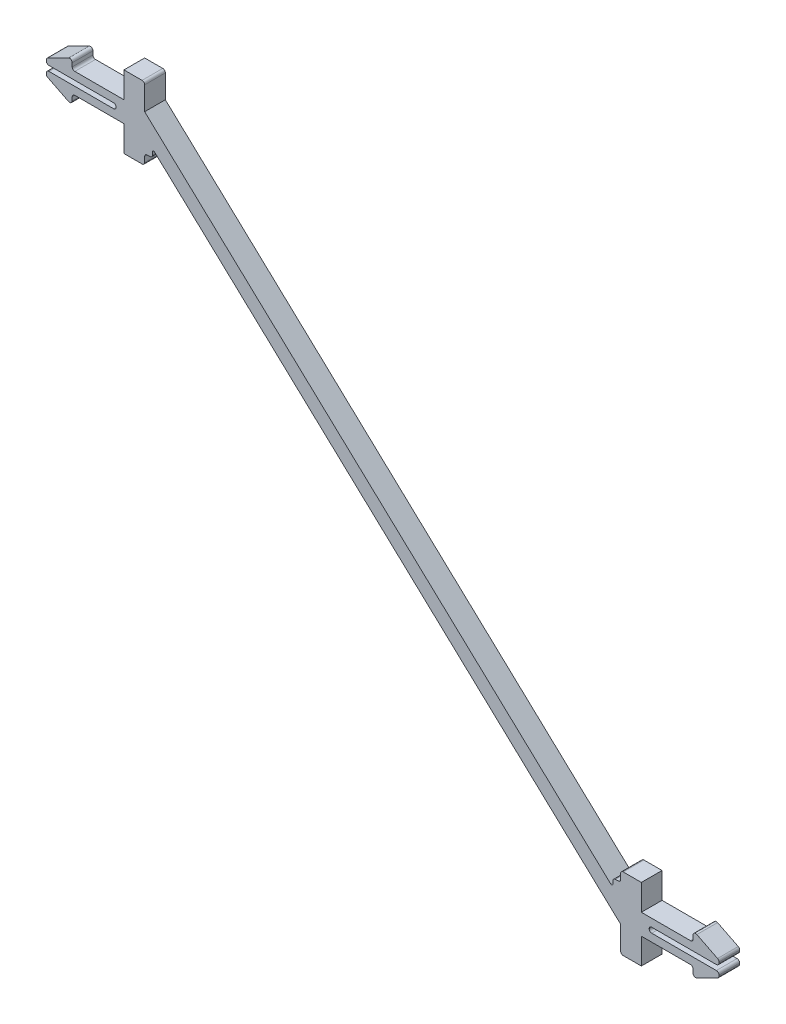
ISO-10303-21;
HEADER;
FILE_DESCRIPTION(('STEP AP214'),'2;1');
FILE_NAME('part.step','',(''),(''),'','','');
FILE_SCHEMA(('AUTOMOTIVE_DESIGN { 1 0 10303 214 1 1 1 1 }'));
ENDSEC;
DATA;
#1=APPLICATION_CONTEXT('core data for automotive mechanical design processes');
#2=APPLICATION_PROTOCOL_DEFINITION('international standard','automotive_design',2000,#1);
#3=PRODUCT_CONTEXT('',#1,'mechanical');
#4=PRODUCT('Part','Part','',(#3));
#5=PRODUCT_RELATED_PRODUCT_CATEGORY('part','',(#4));
#6=PRODUCT_DEFINITION_FORMATION('','',#4);
#7=PRODUCT_DEFINITION_CONTEXT('part definition',#1,'design');
#8=PRODUCT_DEFINITION('design','',#6,#7);
#9=PRODUCT_DEFINITION_SHAPE('','',#8);
#10=(LENGTH_UNIT() NAMED_UNIT(*) SI_UNIT(.MILLI.,.METRE.));
#11=(NAMED_UNIT(*) PLANE_ANGLE_UNIT() SI_UNIT($,.RADIAN.));
#12=(NAMED_UNIT(*) SI_UNIT($,.STERADIAN.) SOLID_ANGLE_UNIT());
#13=UNCERTAINTY_MEASURE_WITH_UNIT(LENGTH_MEASURE(1.E-05),#10,'distance_accuracy_value','');
#14=(GEOMETRIC_REPRESENTATION_CONTEXT(3) GLOBAL_UNCERTAINTY_ASSIGNED_CONTEXT((#13)) GLOBAL_UNIT_ASSIGNED_CONTEXT((#10,
#11,#12)) REPRESENTATION_CONTEXT('',''));
#15=CARTESIAN_POINT('',(0.,0.,0.));
#16=DIRECTION('',(0.,0.,1.));
#17=DIRECTION('',(1.,0.,0.));
#18=AXIS2_PLACEMENT_3D('',#15,#16,#17);
#19=CARTESIAN_POINT('',(9.75681327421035,192.880197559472,-7.99999999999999));
#20=DIRECTION('',(0.,0.,-1.));
#21=DIRECTION('',(0.,-1.,0.));
#22=AXIS2_PLACEMENT_3D('',#19,#20,#21);
#23=PLANE('',#22);
#24=DIRECTION('',(0.,1.,0.));
#25=VECTOR('',#24,1.);
#26=CARTESIAN_POINT('',(-10.2431867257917,184.880197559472,-7.99999999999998));
#27=LINE('',#26,#25);
#28=CARTESIAN_POINT('',(-10.2431867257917,186.498231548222,-7.99999999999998));
#29=VERTEX_POINT('',#28);
#30=CARTESIAN_POINT('',(-10.2431867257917,187.880197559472,-7.99999999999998));
#31=VERTEX_POINT('',#30);
#32=EDGE_CURVE('E811',#29,#31,#27,.T.);
#33=ORIENTED_EDGE('',*,*,#32,.F.);
#34=CARTESIAN_POINT('',(-11.2431867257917,186.498231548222,-7.99999999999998));
#35=DIRECTION('',(0.,0.,-1.));
#36=DIRECTION('',(0.,1.,0.));
#37=AXIS2_PLACEMENT_3D('',#34,#35,#36);
#38=CIRCLE('',#37,1.);
#39=CARTESIAN_POINT('',(-11.6904003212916,185.603804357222,-7.99999999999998));
#40=VERTEX_POINT('',#39);
#41=EDGE_CURVE('E949',#29,#40,#38,.T.);
#42=ORIENTED_EDGE('',*,*,#41,.T.);
#43=DIRECTION('',(0.894427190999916,-0.447213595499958,0.));
#44=VECTOR('',#43,1.);
#45=CARTESIAN_POINT('',(-20.2431867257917,189.880197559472,-7.99999999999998));
#46=LINE('',#45,#44);
#47=CARTESIAN_POINT('',(-19.6904003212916,189.603804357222,-7.99999999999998));
#48=VERTEX_POINT('',#47);
#49=EDGE_CURVE('E814',#48,#40,#46,.T.);
#50=ORIENTED_EDGE('',*,*,#49,.F.);
#51=CARTESIAN_POINT('',(-19.2431867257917,190.498231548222,-7.99999999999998));
#52=DIRECTION('',(0.,0.,-1.));
#53=DIRECTION('',(0.,1.,0.));
#54=AXIS2_PLACEMENT_3D('',#51,#52,#53);
#55=CIRCLE('',#54,1.);
#56=CARTESIAN_POINT('',(-20.2431867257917,190.498231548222,-7.99999999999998));
#57=VERTEX_POINT('',#56);
#58=EDGE_CURVE('E947',#48,#57,#55,.T.);
#59=ORIENTED_EDGE('',*,*,#58,.T.);
#60=DIRECTION('',(0.,-1.,0.));
#61=VECTOR('',#60,1.);
#62=CARTESIAN_POINT('',(-20.2431867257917,191.880197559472,-7.99999999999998));
#63=LINE('',#62,#61);
#64=CARTESIAN_POINT('',(-20.2431867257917,190.880197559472,-7.99999999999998));
#65=VERTEX_POINT('',#64);
#66=EDGE_CURVE('E817',#65,#57,#63,.T.);
#67=ORIENTED_EDGE('',*,*,#66,.F.);
#68=CARTESIAN_POINT('',(-19.2431867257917,190.880197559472,-7.99999999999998));
#69=DIRECTION('',(0.,0.,-1.));
#70=DIRECTION('',(0.,1.,0.));
#71=AXIS2_PLACEMENT_3D('',#68,#69,#70);
#72=CIRCLE('',#71,1.);
#73=CARTESIAN_POINT('',(-19.2431867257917,191.880197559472,-7.99999999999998));
#74=VERTEX_POINT('',#73);
#75=EDGE_CURVE('E945',#65,#74,#72,.T.);
#76=ORIENTED_EDGE('',*,*,#75,.T.);
#77=DIRECTION('',(-1.,0.,0.));
#78=VECTOR('',#77,1.);
#79=CARTESIAN_POINT('',(6.75681327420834,191.880197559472,-7.99999999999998));
#80=LINE('',#79,#78);
#81=CARTESIAN_POINT('',(5.75681327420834,191.880197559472,-7.99999999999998));
#82=VERTEX_POINT('',#81);
#83=EDGE_CURVE('E820',#82,#74,#80,.T.);
#84=ORIENTED_EDGE('',*,*,#83,.F.);
#85=CARTESIAN_POINT('',(5.75681327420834,192.880197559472,-7.99999999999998));
#86=DIRECTION('',(0.,0.,-1.));
#87=DIRECTION('',(0.,1.,0.));
#88=AXIS2_PLACEMENT_3D('',#85,#86,#87);
#89=CIRCLE('',#88,1.);
#90=CARTESIAN_POINT('',(6.75681327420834,192.880197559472,-7.99999999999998));
#91=VERTEX_POINT('',#90);
#92=EDGE_CURVE('E907',#82,#91,#89,.F.);
#93=ORIENTED_EDGE('',*,*,#92,.T.);
#94=CARTESIAN_POINT('',(5.75681327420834,192.880197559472,-7.99999999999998));
#95=DIRECTION('',(0.,0.,-1.));
#96=DIRECTION('',(0.,1.,0.));
#97=AXIS2_PLACEMENT_3D('',#94,#95,#96);
#98=CIRCLE('',#97,1.);
#99=CARTESIAN_POINT('',(5.75681327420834,193.880197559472,-7.99999999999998));
#100=VERTEX_POINT('',#99);
#101=EDGE_CURVE('E911',#91,#100,#98,.F.);
#102=ORIENTED_EDGE('',*,*,#101,.T.);
#103=DIRECTION('',(1.,0.,0.));
#104=VECTOR('',#103,1.);
#105=CARTESIAN_POINT('',(-20.2431867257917,193.880197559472,-7.99999999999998));
#106=LINE('',#105,#104);
#107=CARTESIAN_POINT('',(-19.2431867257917,193.880197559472,-7.99999999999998));
#108=VERTEX_POINT('',#107);
#109=EDGE_CURVE('E823',#108,#100,#106,.T.);
#110=ORIENTED_EDGE('',*,*,#109,.F.);
#111=CARTESIAN_POINT('',(-19.2431867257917,194.880197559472,-7.99999999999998));
#112=DIRECTION('',(0.,0.,-1.));
#113=DIRECTION('',(0.,1.,0.));
#114=AXIS2_PLACEMENT_3D('',#111,#112,#113);
#115=CIRCLE('',#114,1.);
#116=CARTESIAN_POINT('',(-20.2431867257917,194.880197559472,-7.99999999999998));
#117=VERTEX_POINT('',#116);
#118=EDGE_CURVE('E943',#108,#117,#115,.T.);
#119=ORIENTED_EDGE('',*,*,#118,.T.);
#120=DIRECTION('',(0.,-1.,0.));
#121=VECTOR('',#120,1.);
#122=CARTESIAN_POINT('',(-20.2431867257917,195.880197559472,-7.99999999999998));
#123=LINE('',#122,#121);
#124=CARTESIAN_POINT('',(-20.2431867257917,195.262163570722,-7.99999999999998));
#125=VERTEX_POINT('',#124);
#126=EDGE_CURVE('E825',#125,#117,#123,.T.);
#127=ORIENTED_EDGE('',*,*,#126,.F.);
#128=CARTESIAN_POINT('',(-19.2431867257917,195.262163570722,-7.99999999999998));
#129=DIRECTION('',(0.,0.,-1.));
#130=DIRECTION('',(0.,1.,0.));
#131=AXIS2_PLACEMENT_3D('',#128,#129,#130);
#132=CIRCLE('',#131,1.);
#133=CARTESIAN_POINT('',(-19.6904003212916,196.156590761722,-7.99999999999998));
#134=VERTEX_POINT('',#133);
#135=EDGE_CURVE('E941',#125,#134,#132,.T.);
#136=ORIENTED_EDGE('',*,*,#135,.T.);
#137=DIRECTION('',(-0.894427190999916,-0.447213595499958,0.));
#138=VECTOR('',#137,1.);
#139=CARTESIAN_POINT('',(-10.2431867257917,200.880197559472,-7.99999999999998));
#140=LINE('',#139,#138);
#141=CARTESIAN_POINT('',(-11.6904003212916,200.156590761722,-7.99999999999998));
#142=VERTEX_POINT('',#141);
#143=EDGE_CURVE('E828',#142,#134,#140,.T.);
#144=ORIENTED_EDGE('',*,*,#143,.F.);
#145=CARTESIAN_POINT('',(-11.2431867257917,199.262163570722,-7.99999999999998));
#146=DIRECTION('',(0.,0.,-1.));
#147=DIRECTION('',(0.,1.,0.));
#148=AXIS2_PLACEMENT_3D('',#145,#146,#147);
#149=CIRCLE('',#148,1.);
#150=CARTESIAN_POINT('',(-10.2431867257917,199.262163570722,-7.99999999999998));
#151=VERTEX_POINT('',#150);
#152=EDGE_CURVE('E66',#142,#151,#149,.T.);
#153=ORIENTED_EDGE('',*,*,#152,.T.);
#154=DIRECTION('',(0.,1.,0.));
#155=VECTOR('',#154,1.);
#156=CARTESIAN_POINT('',(-10.2431867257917,196.880197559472,-7.99999999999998));
#157=LINE('',#156,#155);
#158=CARTESIAN_POINT('',(-10.2431867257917,197.880197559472,-7.99999999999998));
#159=VERTEX_POINT('',#158);
#160=EDGE_CURVE('E831',#159,#151,#157,.T.);
#161=ORIENTED_EDGE('',*,*,#160,.F.);
#162=CARTESIAN_POINT('',(-9.24318672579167,197.880197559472,-7.99999999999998));
#163=DIRECTION('',(0.,0.,-1.));
#164=DIRECTION('',(0.,1.,0.));
#165=AXIS2_PLACEMENT_3D('',#162,#163,#164);
#166=CIRCLE('',#165,1.);
#167=CARTESIAN_POINT('',(-9.24318672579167,196.880197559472,-7.99999999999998));
#168=VERTEX_POINT('',#167);
#169=EDGE_CURVE('E12',#159,#168,#166,.F.);
#170=ORIENTED_EDGE('',*,*,#169,.T.);
#171=DIRECTION('',(-1.,0.,0.));
#172=VECTOR('',#171,1.);
#173=CARTESIAN_POINT('',(-10.2431867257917,196.880197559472,-7.99999999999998));
#174=LINE('',#173,#172);
#175=CARTESIAN_POINT('',(9.75681327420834,196.880197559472,-7.99999999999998));
#176=VERTEX_POINT('',#175);
#177=EDGE_CURVE('E833',#176,#168,#174,.T.);
#178=ORIENTED_EDGE('',*,*,#177,.F.);
#179=DIRECTION('',(0.,-1.,0.));
#180=VECTOR('',#179,1.);
#181=CARTESIAN_POINT('',(9.75681327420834,196.880197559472,-7.99999999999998));
#182=LINE('',#181,#180);
#183=CARTESIAN_POINT('',(9.75681327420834,206.880197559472,-7.99999999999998));
#184=VERTEX_POINT('',#183);
#185=EDGE_CURVE('E836',#184,#176,#182,.T.);
#186=ORIENTED_EDGE('',*,*,#185,.F.);
#187=DIRECTION('',(-1.,0.,0.));
#188=VECTOR('',#187,1.);
#189=CARTESIAN_POINT('',(9.75681327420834,206.880197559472,-7.99999999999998));
#190=LINE('',#189,#188);
#191=CARTESIAN_POINT('',(16.7568132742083,206.880197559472,-7.99999999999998));
#192=VERTEX_POINT('',#191);
#193=EDGE_CURVE('E840',#192,#184,#190,.T.);
#194=ORIENTED_EDGE('',*,*,#193,.F.);
#195=CARTESIAN_POINT('',(16.7568132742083,205.880197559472,-7.99999999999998));
#196=DIRECTION('',(0.,0.,-1.));
#197=DIRECTION('',(0.,1.,0.));
#198=AXIS2_PLACEMENT_3D('',#195,#196,#197);
#199=CIRCLE('',#198,1.);
#200=CARTESIAN_POINT('',(17.7568132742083,205.880197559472,-7.99999999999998));
#201=VERTEX_POINT('',#200);
#202=EDGE_CURVE('E869',#192,#201,#199,.T.);
#203=ORIENTED_EDGE('',*,*,#202,.T.);
#204=DIRECTION('',(0.,1.,0.));
#205=VECTOR('',#204,1.);
#206=CARTESIAN_POINT('',(17.7568132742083,206.880197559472,-7.99999999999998));
#207=LINE('',#206,#205);
#208=CARTESIAN_POINT('',(17.7568132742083,196.880197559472,-7.99999999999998));
#209=VERTEX_POINT('',#208);
#210=EDGE_CURVE('E842',#209,#201,#207,.T.);
#211=ORIENTED_EDGE('',*,*,#210,.F.);
#212=DIRECTION('',(-0.730526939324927,0.682883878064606,0.));
#213=VECTOR('',#212,1.);
#214=CARTESIAN_POINT('',(17.7568132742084,196.880197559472,-7.99999999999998));
#215=LINE('',#214,#213);
#216=CARTESIAN_POINT('',(197.915371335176,28.4711106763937,-7.99999999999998));
#217=VERTEX_POINT('',#216);
#218=EDGE_CURVE('E790',#217,#209,#215,.T.);
#219=ORIENTED_EDGE('',*,*,#218,.F.);
#220=CARTESIAN_POINT('',(198.256813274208,28.8363741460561,-7.99999999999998));
#221=DIRECTION('',(0.,0.,-1.));
#222=DIRECTION('',(0.,-1.,0.));
#223=AXIS2_PLACEMENT_3D('',#220,#221,#222);
#224=CIRCLE('',#223,0.5);
#225=CARTESIAN_POINT('',(198.756813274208,28.8363741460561,-7.99999999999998));
#226=VERTEX_POINT('',#225);
#227=EDGE_CURVE('E641',#217,#226,#224,.F.);
#228=ORIENTED_EDGE('',*,*,#227,.T.);
#229=DIRECTION('',(0.,-1.,0.));
#230=VECTOR('',#229,1.);
#231=CARTESIAN_POINT('',(198.756813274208,27.6845453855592,-7.99999999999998));
#232=LINE('',#231,#230);
#233=CARTESIAN_POINT('',(198.756813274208,29.8801975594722,-7.99999999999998));
#234=VERTEX_POINT('',#233);
#235=EDGE_CURVE('E540',#234,#226,#232,.T.);
#236=ORIENTED_EDGE('',*,*,#235,.F.);
#237=CARTESIAN_POINT('',(199.756813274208,29.8801975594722,-7.99999999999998));
#238=DIRECTION('',(0.,0.,-1.));
#239=DIRECTION('',(0.,-1.,0.));
#240=AXIS2_PLACEMENT_3D('',#237,#238,#239);
#241=CIRCLE('',#240,1.);
#242=CARTESIAN_POINT('',(199.756813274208,30.8801975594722,-7.99999999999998));
#243=VERTEX_POINT('',#242);
#244=EDGE_CURVE('E609',#234,#243,#241,.T.);
#245=ORIENTED_EDGE('',*,*,#244,.T.);
#246=DIRECTION('',(-1.,0.,0.));
#247=VECTOR('',#246,1.);
#248=CARTESIAN_POINT('',(198.756813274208,30.8801975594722,-7.99999999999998));
#249=LINE('',#248,#247);
#250=CARTESIAN_POINT('',(200.756813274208,30.8801975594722,-7.99999999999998));
#251=VERTEX_POINT('',#250);
#252=EDGE_CURVE('E544',#251,#243,#249,.T.);
#253=ORIENTED_EDGE('',*,*,#252,.F.);
#254=CARTESIAN_POINT('',(200.756813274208,31.8801975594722,-7.99999999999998));
#255=DIRECTION('',(0.,0.,-1.));
#256=DIRECTION('',(0.,-1.,0.));
#257=AXIS2_PLACEMENT_3D('',#254,#255,#256);
#258=CIRCLE('',#257,1.);
#259=CARTESIAN_POINT('',(201.756813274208,31.8801975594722,-7.99999999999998));
#260=VERTEX_POINT('',#259);
#261=EDGE_CURVE('E636',#251,#260,#258,.F.);
#262=ORIENTED_EDGE('',*,*,#261,.T.);
#263=DIRECTION('',(0.,-1.,0.));
#264=VECTOR('',#263,1.);
#265=CARTESIAN_POINT('',(201.756813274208,30.8801975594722,-7.99999999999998));
#266=LINE('',#265,#264);
#267=CARTESIAN_POINT('',(201.756813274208,33.8801975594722,-7.99999999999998));
#268=VERTEX_POINT('',#267);
#269=EDGE_CURVE('E547',#268,#260,#266,.T.);
#270=ORIENTED_EDGE('',*,*,#269,.F.);
#271=CARTESIAN_POINT('',(202.756813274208,33.8801975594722,-7.99999999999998));
#272=DIRECTION('',(0.,0.,-1.));
#273=DIRECTION('',(0.,-1.,0.));
#274=AXIS2_PLACEMENT_3D('',#271,#272,#273);
#275=CIRCLE('',#274,1.);
#276=CARTESIAN_POINT('',(202.756813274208,34.8801975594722,-7.99999999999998));
#277=VERTEX_POINT('',#276);
#278=EDGE_CURVE('E611',#268,#277,#275,.T.);
#279=ORIENTED_EDGE('',*,*,#278,.T.);
#280=DIRECTION('',(-1.,0.,0.));
#281=VECTOR('',#280,1.);
#282=CARTESIAN_POINT('',(201.756813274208,34.8801975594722,-7.99999999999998));
#283=LINE('',#282,#281);
#284=CARTESIAN_POINT('',(209.756813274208,34.8801975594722,-7.99999999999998));
#285=VERTEX_POINT('',#284);
#286=EDGE_CURVE('E482',#285,#277,#283,.T.);
#287=ORIENTED_EDGE('',*,*,#286,.F.);
#288=DIRECTION('',(0.,1.,0.));
#289=VECTOR('',#288,1.);
#290=CARTESIAN_POINT('',(209.756813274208,34.8801975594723,-7.99999999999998));
#291=LINE('',#290,#289);
#292=CARTESIAN_POINT('',(209.756813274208,24.8801975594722,-7.99999999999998));
#293=VERTEX_POINT('',#292);
#294=EDGE_CURVE('E479',#293,#285,#291,.T.);
#295=ORIENTED_EDGE('',*,*,#294,.F.);
#296=DIRECTION('',(-1.,0.,0.));
#297=VECTOR('',#296,1.);
#298=CARTESIAN_POINT('',(209.756813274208,24.8801975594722,-7.99999999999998));
#299=LINE('',#298,#297);
#300=CARTESIAN_POINT('',(228.756813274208,24.8801975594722,-7.99999999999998));
#301=VERTEX_POINT('',#300);
#302=EDGE_CURVE('E553',#301,#293,#299,.T.);
#303=ORIENTED_EDGE('',*,*,#302,.F.);
#304=CARTESIAN_POINT('',(228.756813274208,25.8801975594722,-7.99999999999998));
#305=DIRECTION('',(0.,0.,-1.));
#306=DIRECTION('',(0.,-1.,0.));
#307=AXIS2_PLACEMENT_3D('',#304,#305,#306);
#308=CIRCLE('',#307,1.);
#309=CARTESIAN_POINT('',(229.756813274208,25.8801975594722,-7.99999999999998));
#310=VERTEX_POINT('',#309);
#311=EDGE_CURVE('E726',#301,#310,#308,.F.);
#312=ORIENTED_EDGE('',*,*,#311,.T.);
#313=DIRECTION('',(0.,-1.,0.));
#314=VECTOR('',#313,1.);
#315=CARTESIAN_POINT('',(229.756813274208,28.8801975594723,-7.99999999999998));
#316=LINE('',#315,#314);
#317=CARTESIAN_POINT('',(229.756813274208,27.2621635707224,-7.99999999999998));
#318=VERTEX_POINT('',#317);
#319=EDGE_CURVE('E555',#318,#310,#316,.T.);
#320=ORIENTED_EDGE('',*,*,#319,.F.);
#321=CARTESIAN_POINT('',(230.756813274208,27.2621635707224,-7.99999999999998));
#322=DIRECTION('',(0.,0.,-1.));
#323=DIRECTION('',(0.,-1.,0.));
#324=AXIS2_PLACEMENT_3D('',#321,#322,#323);
#325=CIRCLE('',#324,1.);
#326=CARTESIAN_POINT('',(231.204026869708,28.1565907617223,-7.99999999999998));
#327=VERTEX_POINT('',#326);
#328=EDGE_CURVE('E694',#318,#327,#325,.T.);
#329=ORIENTED_EDGE('',*,*,#328,.T.);
#330=DIRECTION('',(-0.894427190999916,0.447213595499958,0.));
#331=VECTOR('',#330,1.);
#332=CARTESIAN_POINT('',(239.756813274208,23.8801975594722,-7.99999999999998));
#333=LINE('',#332,#331);
#334=CARTESIAN_POINT('',(239.204026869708,24.1565907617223,-7.99999999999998));
#335=VERTEX_POINT('',#334);
#336=EDGE_CURVE('E558',#335,#327,#333,.T.);
#337=ORIENTED_EDGE('',*,*,#336,.F.);
#338=CARTESIAN_POINT('',(238.756813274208,23.2621635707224,-7.99999999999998));
#339=DIRECTION('',(0.,0.,-1.));
#340=DIRECTION('',(0.,-1.,0.));
#341=AXIS2_PLACEMENT_3D('',#338,#339,#340);
#342=CIRCLE('',#341,1.);
#343=CARTESIAN_POINT('',(239.756813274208,23.2621635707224,-7.99999999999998));
#344=VERTEX_POINT('',#343);
#345=EDGE_CURVE('E692',#335,#344,#342,.T.);
#346=ORIENTED_EDGE('',*,*,#345,.T.);
#347=DIRECTION('',(0.,1.,0.));
#348=VECTOR('',#347,1.);
#349=CARTESIAN_POINT('',(239.756813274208,21.8801975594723,-7.99999999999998));
#350=LINE('',#349,#348);
#351=CARTESIAN_POINT('',(239.756813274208,22.8801975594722,-7.99999999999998));
#352=VERTEX_POINT('',#351);
#353=EDGE_CURVE('E561',#352,#344,#350,.T.);
#354=ORIENTED_EDGE('',*,*,#353,.F.);
#355=CARTESIAN_POINT('',(238.756813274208,22.8801975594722,-7.99999999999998));
#356=DIRECTION('',(0.,0.,-1.));
#357=DIRECTION('',(0.,-1.,0.));
#358=AXIS2_PLACEMENT_3D('',#355,#356,#357);
#359=CIRCLE('',#358,1.);
#360=CARTESIAN_POINT('',(238.756813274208,21.8801975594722,-7.99999999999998));
#361=VERTEX_POINT('',#360);
#362=EDGE_CURVE('E690',#352,#361,#359,.T.);
#363=ORIENTED_EDGE('',*,*,#362,.T.);
#364=DIRECTION('',(1.,0.,0.));
#365=VECTOR('',#364,1.);
#366=CARTESIAN_POINT('',(212.756813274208,21.8801975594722,-7.99999999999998));
#367=LINE('',#366,#365);
#368=CARTESIAN_POINT('',(213.756813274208,21.8801975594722,-7.99999999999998));
#369=VERTEX_POINT('',#368);
#370=EDGE_CURVE('E564',#369,#361,#367,.T.);
#371=ORIENTED_EDGE('',*,*,#370,.F.);
#372=CARTESIAN_POINT('',(213.756813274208,20.8801975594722,-7.99999999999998));
#373=DIRECTION('',(0.,0.,-1.));
#374=DIRECTION('',(0.,-1.,0.));
#375=AXIS2_PLACEMENT_3D('',#372,#373,#374);
#376=CIRCLE('',#375,1.);
#377=CARTESIAN_POINT('',(212.756813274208,20.8801975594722,-7.99999999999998));
#378=VERTEX_POINT('',#377);
#379=EDGE_CURVE('E651',#369,#378,#376,.F.);
#380=ORIENTED_EDGE('',*,*,#379,.T.);
#381=CARTESIAN_POINT('',(213.756813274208,20.8801975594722,-7.99999999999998));
#382=DIRECTION('',(0.,0.,-1.));
#383=DIRECTION('',(0.,-1.,0.));
#384=AXIS2_PLACEMENT_3D('',#381,#382,#383);
#385=CIRCLE('',#384,1.);
#386=CARTESIAN_POINT('',(213.756813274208,19.8801975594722,-7.99999999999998));
#387=VERTEX_POINT('',#386);
#388=EDGE_CURVE('E655',#378,#387,#385,.F.);
#389=ORIENTED_EDGE('',*,*,#388,.T.);
#390=DIRECTION('',(-1.,0.,0.));
#391=VECTOR('',#390,1.);
#392=CARTESIAN_POINT('',(239.756813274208,19.8801975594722,-7.99999999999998));
#393=LINE('',#392,#391);
#394=CARTESIAN_POINT('',(238.756813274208,19.8801975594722,-7.99999999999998));
#395=VERTEX_POINT('',#394);
#396=EDGE_CURVE('E567',#395,#387,#393,.T.);
#397=ORIENTED_EDGE('',*,*,#396,.F.);
#398=CARTESIAN_POINT('',(238.756813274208,18.8801975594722,-7.99999999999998));
#399=DIRECTION('',(0.,0.,-1.));
#400=DIRECTION('',(0.,-1.,0.));
#401=AXIS2_PLACEMENT_3D('',#398,#399,#400);
#402=CIRCLE('',#401,1.);
#403=CARTESIAN_POINT('',(239.756813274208,18.8801975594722,-7.99999999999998));
#404=VERTEX_POINT('',#403);
#405=EDGE_CURVE('E688',#395,#404,#402,.T.);
#406=ORIENTED_EDGE('',*,*,#405,.T.);
#407=DIRECTION('',(0.,1.,0.));
#408=VECTOR('',#407,1.);
#409=CARTESIAN_POINT('',(239.756813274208,17.8801975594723,-7.99999999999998));
#410=LINE('',#409,#408);
#411=CARTESIAN_POINT('',(239.756813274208,18.4982315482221,-7.99999999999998));
#412=VERTEX_POINT('',#411);
#413=EDGE_CURVE('E569',#412,#404,#410,.T.);
#414=ORIENTED_EDGE('',*,*,#413,.F.);
#415=CARTESIAN_POINT('',(238.756813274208,18.4982315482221,-7.99999999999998));
#416=DIRECTION('',(0.,0.,-1.));
#417=DIRECTION('',(0.,-1.,0.));
#418=AXIS2_PLACEMENT_3D('',#415,#416,#417);
#419=CIRCLE('',#418,1.);
#420=CARTESIAN_POINT('',(239.204026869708,17.6038043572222,-7.99999999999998));
#421=VERTEX_POINT('',#420);
#422=EDGE_CURVE('E686',#412,#421,#419,.T.);
#423=ORIENTED_EDGE('',*,*,#422,.T.);
#424=DIRECTION('',(0.894427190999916,0.447213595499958,0.));
#425=VECTOR('',#424,1.);
#426=CARTESIAN_POINT('',(229.756813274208,12.8801975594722,-7.99999999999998));
#427=LINE('',#426,#425);
#428=CARTESIAN_POINT('',(231.204026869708,13.6038043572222,-7.99999999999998));
#429=VERTEX_POINT('',#428);
#430=EDGE_CURVE('E572',#429,#421,#427,.T.);
#431=ORIENTED_EDGE('',*,*,#430,.F.);
#432=CARTESIAN_POINT('',(230.756813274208,14.4982315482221,-7.99999999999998));
#433=DIRECTION('',(0.,0.,-1.));
#434=DIRECTION('',(0.,-1.,0.));
#435=AXIS2_PLACEMENT_3D('',#432,#433,#434);
#436=CIRCLE('',#435,1.);
#437=CARTESIAN_POINT('',(229.756813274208,14.4982315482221,-7.99999999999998));
#438=VERTEX_POINT('',#437);
#439=EDGE_CURVE('E684',#429,#438,#436,.T.);
#440=ORIENTED_EDGE('',*,*,#439,.T.);
#441=DIRECTION('',(0.,-1.,0.));
#442=VECTOR('',#441,1.);
#443=CARTESIAN_POINT('',(229.756813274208,16.8801975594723,-7.99999999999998));
#444=LINE('',#443,#442);
#445=CARTESIAN_POINT('',(229.756813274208,15.8801975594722,-7.99999999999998));
#446=VERTEX_POINT('',#445);
#447=EDGE_CURVE('E575',#446,#438,#444,.T.);
#448=ORIENTED_EDGE('',*,*,#447,.F.);
#449=CARTESIAN_POINT('',(228.756813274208,15.8801975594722,-7.99999999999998));
#450=DIRECTION('',(0.,0.,-1.));
#451=DIRECTION('',(0.,-1.,0.));
#452=AXIS2_PLACEMENT_3D('',#449,#450,#451);
#453=CIRCLE('',#452,1.);
#454=CARTESIAN_POINT('',(228.756813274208,16.8801975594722,-7.99999999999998));
#455=VERTEX_POINT('',#454);
#456=EDGE_CURVE('E730',#446,#455,#453,.F.);
#457=ORIENTED_EDGE('',*,*,#456,.T.);
#458=DIRECTION('',(1.,0.,0.));
#459=VECTOR('',#458,1.);
#460=CARTESIAN_POINT('',(229.756813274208,16.8801975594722,-7.99999999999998));
#461=LINE('',#460,#459);
#462=CARTESIAN_POINT('',(209.756813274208,16.8801975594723,-7.99999999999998));
#463=VERTEX_POINT('',#462);
#464=EDGE_CURVE('E578',#463,#455,#461,.T.);
#465=ORIENTED_EDGE('',*,*,#464,.F.);
#466=DIRECTION('',(0.,1.,0.));
#467=VECTOR('',#466,1.);
#468=CARTESIAN_POINT('',(209.756813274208,16.8801975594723,-7.99999999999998));
#469=LINE('',#468,#467);
#470=CARTESIAN_POINT('',(209.756813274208,6.88019755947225,-7.99999999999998));
#471=VERTEX_POINT('',#470);
#472=EDGE_CURVE('E582',#471,#463,#469,.T.);
#473=ORIENTED_EDGE('',*,*,#472,.F.);
#474=DIRECTION('',(1.,0.,0.));
#475=VECTOR('',#474,1.);
#476=CARTESIAN_POINT('',(209.756813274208,6.88019755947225,-7.99999999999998));
#477=LINE('',#476,#475);
#478=CARTESIAN_POINT('',(202.756813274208,6.88019755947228,-7.99999999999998));
#479=VERTEX_POINT('',#478);
#480=EDGE_CURVE('E586',#479,#471,#477,.T.);
#481=ORIENTED_EDGE('',*,*,#480,.F.);
#482=CARTESIAN_POINT('',(202.756813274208,7.88019755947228,-7.99999999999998));
#483=DIRECTION('',(0.,0.,-1.));
#484=DIRECTION('',(0.,-1.,0.));
#485=AXIS2_PLACEMENT_3D('',#482,#483,#484);
#486=CIRCLE('',#485,1.);
#487=CARTESIAN_POINT('',(201.756813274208,7.88019755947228,-7.99999999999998));
#488=VERTEX_POINT('',#487);
#489=EDGE_CURVE('E613',#479,#488,#486,.T.);
#490=ORIENTED_EDGE('',*,*,#489,.T.);
#491=DIRECTION('',(0.,-1.,0.));
#492=VECTOR('',#491,1.);
#493=CARTESIAN_POINT('',(201.756813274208,6.88019755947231,-7.99999999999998));
#494=LINE('',#493,#492);
#495=CARTESIAN_POINT('',(201.756813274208,16.8801975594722,-7.99999999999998));
#496=VERTEX_POINT('',#495);
#497=EDGE_CURVE('E588',#496,#488,#494,.T.);
#498=ORIENTED_EDGE('',*,*,#497,.F.);
#499=DIRECTION('',(0.730526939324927,-0.682883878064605,0.));
#500=VECTOR('',#499,1.);
#501=CARTESIAN_POINT('',(20.7568132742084,186.075849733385,-7.99999999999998));
#502=LINE('',#501,#500);
#503=CARTESIAN_POINT('',(21.5982552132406,185.289284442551,-7.99999999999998));
#504=VERTEX_POINT('',#503);
#505=EDGE_CURVE('E736',#504,#496,#502,.T.);
#506=ORIENTED_EDGE('',*,*,#505,.F.);
#507=CARTESIAN_POINT('',(21.2568132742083,184.924020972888,-7.99999999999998));
#508=DIRECTION('',(0.,0.,-1.));
#509=DIRECTION('',(0.,1.,0.));
#510=AXIS2_PLACEMENT_3D('',#507,#508,#509);
#511=CIRCLE('',#510,0.5);
#512=CARTESIAN_POINT('',(20.7568132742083,184.924020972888,-7.99999999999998));
#513=VERTEX_POINT('',#512);
#514=EDGE_CURVE('E897',#504,#513,#511,.F.);
#515=ORIENTED_EDGE('',*,*,#514,.T.);
#516=DIRECTION('',(0.,1.,0.));
#517=VECTOR('',#516,1.);
#518=CARTESIAN_POINT('',(20.7568132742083,186.075849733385,-7.99999999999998));
#519=LINE('',#518,#517);
#520=CARTESIAN_POINT('',(20.7568132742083,183.880197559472,-7.99999999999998));
#521=VERTEX_POINT('',#520);
#522=EDGE_CURVE('E791',#521,#513,#519,.T.);
#523=ORIENTED_EDGE('',*,*,#522,.F.);
#524=CARTESIAN_POINT('',(19.7568132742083,183.880197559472,-7.99999999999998));
#525=DIRECTION('',(0.,0.,-1.));
#526=DIRECTION('',(0.,1.,0.));
#527=AXIS2_PLACEMENT_3D('',#524,#525,#526);
#528=CIRCLE('',#527,1.);
#529=CARTESIAN_POINT('',(19.7568132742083,182.880197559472,-7.99999999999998));
#530=VERTEX_POINT('',#529);
#531=EDGE_CURVE('E865',#521,#530,#528,.T.);
#532=ORIENTED_EDGE('',*,*,#531,.T.);
#533=DIRECTION('',(1.,0.,0.));
#534=VECTOR('',#533,1.);
#535=CARTESIAN_POINT('',(20.7568132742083,182.880197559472,-7.99999999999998));
#536=LINE('',#535,#534);
#537=CARTESIAN_POINT('',(18.7568132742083,182.880197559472,-7.99999999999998));
#538=VERTEX_POINT('',#537);
#539=EDGE_CURVE('E795',#538,#530,#536,.T.);
#540=ORIENTED_EDGE('',*,*,#539,.F.);
#541=CARTESIAN_POINT('',(18.7568132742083,181.880197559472,-7.99999999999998));
#542=DIRECTION('',(0.,0.,-1.));
#543=DIRECTION('',(0.,1.,0.));
#544=AXIS2_PLACEMENT_3D('',#541,#542,#543);
#545=CIRCLE('',#544,1.);
#546=CARTESIAN_POINT('',(17.7568132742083,181.880197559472,-7.99999999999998));
#547=VERTEX_POINT('',#546);
#548=EDGE_CURVE('E893',#538,#547,#545,.F.);
#549=ORIENTED_EDGE('',*,*,#548,.T.);
#550=DIRECTION('',(0.,1.,0.));
#551=VECTOR('',#550,1.);
#552=CARTESIAN_POINT('',(17.7568132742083,182.880197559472,-7.99999999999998));
#553=LINE('',#552,#551);
#554=CARTESIAN_POINT('',(17.7568132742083,179.880197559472,-7.99999999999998));
#555=VERTEX_POINT('',#554);
#556=EDGE_CURVE('E798',#555,#547,#553,.T.);
#557=ORIENTED_EDGE('',*,*,#556,.F.);
#558=CARTESIAN_POINT('',(16.7568132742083,179.880197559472,-7.99999999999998));
#559=DIRECTION('',(0.,0.,-1.));
#560=DIRECTION('',(0.,1.,0.));
#561=AXIS2_PLACEMENT_3D('',#558,#559,#560);
#562=CIRCLE('',#561,1.);
#563=CARTESIAN_POINT('',(16.7568132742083,178.880197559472,-7.99999999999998));
#564=VERTEX_POINT('',#563);
#565=EDGE_CURVE('E867',#555,#564,#562,.T.);
#566=ORIENTED_EDGE('',*,*,#565,.T.);
#567=DIRECTION('',(1.,0.,0.));
#568=VECTOR('',#567,1.);
#569=CARTESIAN_POINT('',(17.7568132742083,178.880197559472,-7.99999999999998));
#570=LINE('',#569,#568);
#571=CARTESIAN_POINT('',(9.75681327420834,178.880197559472,-7.99999999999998));
#572=VERTEX_POINT('',#571);
#573=EDGE_CURVE('E801',#572,#564,#570,.T.);
#574=ORIENTED_EDGE('',*,*,#573,.F.);
#575=DIRECTION('',(0.,-1.,0.));
#576=VECTOR('',#575,1.);
#577=CARTESIAN_POINT('',(9.75681327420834,178.880197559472,-7.99999999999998));
#578=LINE('',#577,#576);
#579=CARTESIAN_POINT('',(9.75681327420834,188.880197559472,-7.99999999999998));
#580=VERTEX_POINT('',#579);
#581=EDGE_CURVE('E805',#580,#572,#578,.T.);
#582=ORIENTED_EDGE('',*,*,#581,.F.);
#583=DIRECTION('',(1.,0.,0.));
#584=VECTOR('',#583,1.);
#585=CARTESIAN_POINT('',(9.75681327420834,188.880197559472,-7.99999999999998));
#586=LINE('',#585,#584);
#587=CARTESIAN_POINT('',(-9.24318672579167,188.880197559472,-7.99999999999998));
#588=VERTEX_POINT('',#587);
#589=EDGE_CURVE('E809',#588,#580,#586,.T.);
#590=ORIENTED_EDGE('',*,*,#589,.F.);
#591=CARTESIAN_POINT('',(-9.24318672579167,187.880197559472,-7.99999999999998));
#592=DIRECTION('',(0.,0.,-1.));
#593=DIRECTION('',(0.,1.,0.));
#594=AXIS2_PLACEMENT_3D('',#591,#592,#593);
#595=CIRCLE('',#594,1.);
#596=EDGE_CURVE('E981',#588,#31,#595,.F.);
#597=ORIENTED_EDGE('',*,*,#596,.T.);
#598=EDGE_LOOP('',(#33,#42,#50,#59,#67,#76,#84,#93,#102,#110,#119,#127,#136,#144,#153,#161,#170,
#178,#186,#194,#203,#211,#219,#228,#236,#245,#253,#262,#270,#279,#287,#295,#303,#312,#320,#329,
#337,#346,#354,#363,#371,#380,#389,#397,#406,#414,#423,#431,#440,#448,#457,#465,#473,#481,#490,
#498,#506,#515,#523,#532,#540,#549,#557,#566,#574,#582,#590,#597));
#599=FACE_BOUND('',#598,.T.);
#600=ADVANCED_FACE('F47',(#599),#23,.T.);
#601=CARTESIAN_POINT('',(0.,0.,0.));
#602=DIRECTION('',(0.,0.,-1.));
#603=DIRECTION('',(-1.,0.,0.));
#604=AXIS2_PLACEMENT_3D('',#601,#602,#603);
#605=PLANE('',#604);
#606=DIRECTION('',(0.894427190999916,-0.447213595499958,0.));
#607=VECTOR('',#606,1.);
#608=CARTESIAN_POINT('',(-20.2431867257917,189.880197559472,0.));
#609=LINE('',#608,#607);
#610=CARTESIAN_POINT('',(-19.6904003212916,189.603804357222,0.));
#611=VERTEX_POINT('',#610);
#612=CARTESIAN_POINT('',(-11.6904003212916,185.603804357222,0.));
#613=VERTEX_POINT('',#612);
#614=EDGE_CURVE('E751',#611,#613,#609,.T.);
#615=ORIENTED_EDGE('',*,*,#614,.T.);
#616=CARTESIAN_POINT('',(-11.2431867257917,186.498231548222,0.));
#617=DIRECTION('',(0.,0.,-1.));
#618=DIRECTION('',(-1.,0.,0.));
#619=AXIS2_PLACEMENT_3D('',#616,#617,#618);
#620=CIRCLE('',#619,1.);
#621=CARTESIAN_POINT('',(-10.2431867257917,186.498231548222,0.));
#622=VERTEX_POINT('',#621);
#623=EDGE_CURVE('E938',#613,#622,#620,.F.);
#624=ORIENTED_EDGE('',*,*,#623,.T.);
#625=DIRECTION('',(0.,1.,0.));
#626=VECTOR('',#625,1.);
#627=CARTESIAN_POINT('',(-10.2431867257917,184.880197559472,0.));
#628=LINE('',#627,#626);
#629=CARTESIAN_POINT('',(-10.2431867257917,187.880197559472,0.));
#630=VERTEX_POINT('',#629);
#631=EDGE_CURVE('E748',#622,#630,#628,.T.);
#632=ORIENTED_EDGE('',*,*,#631,.T.);
#633=CARTESIAN_POINT('',(-9.24318672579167,187.880197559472,0.));
#634=DIRECTION('',(0.,0.,-1.));
#635=DIRECTION('',(-1.,0.,0.));
#636=AXIS2_PLACEMENT_3D('',#633,#634,#635);
#637=CIRCLE('',#636,1.);
#638=CARTESIAN_POINT('',(-9.24318672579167,188.880197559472,0.));
#639=VERTEX_POINT('',#638);
#640=EDGE_CURVE('E979',#630,#639,#637,.T.);
#641=ORIENTED_EDGE('',*,*,#640,.T.);
#642=DIRECTION('',(1.,0.,0.));
#643=VECTOR('',#642,1.);
#644=CARTESIAN_POINT('',(9.75681327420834,188.880197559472,0.));
#645=LINE('',#644,#643);
#646=CARTESIAN_POINT('',(9.75681327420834,188.880197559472,0.));
#647=VERTEX_POINT('',#646);
#648=EDGE_CURVE('E746',#639,#647,#645,.T.);
#649=ORIENTED_EDGE('',*,*,#648,.T.);
#650=DIRECTION('',(0.,-1.,0.));
#651=VECTOR('',#650,1.);
#652=CARTESIAN_POINT('',(9.75681327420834,178.880197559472,0.));
#653=LINE('',#652,#651);
#654=CARTESIAN_POINT('',(9.75681327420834,178.880197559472,0.));
#655=VERTEX_POINT('',#654);
#656=EDGE_CURVE('E743',#647,#655,#653,.T.);
#657=ORIENTED_EDGE('',*,*,#656,.T.);
#658=DIRECTION('',(1.,0.,0.));
#659=VECTOR('',#658,1.);
#660=CARTESIAN_POINT('',(17.7568132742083,178.880197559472,0.));
#661=LINE('',#660,#659);
#662=CARTESIAN_POINT('',(16.7568132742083,178.880197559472,0.));
#663=VERTEX_POINT('',#662);
#664=EDGE_CURVE('E740',#655,#663,#661,.T.);
#665=ORIENTED_EDGE('',*,*,#664,.T.);
#666=CARTESIAN_POINT('',(16.7568132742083,179.880197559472,0.));
#667=DIRECTION('',(0.,0.,-1.));
#668=DIRECTION('',(-1.,0.,0.));
#669=AXIS2_PLACEMENT_3D('',#666,#667,#668);
#670=CIRCLE('',#669,1.);
#671=CARTESIAN_POINT('',(17.7568132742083,179.880197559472,0.));
#672=VERTEX_POINT('',#671);
#673=EDGE_CURVE('E859',#663,#672,#670,.F.);
#674=ORIENTED_EDGE('',*,*,#673,.T.);
#675=DIRECTION('',(0.,1.,0.));
#676=VECTOR('',#675,1.);
#677=CARTESIAN_POINT('',(17.7568132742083,182.880197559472,0.));
#678=LINE('',#677,#676);
#679=CARTESIAN_POINT('',(17.7568132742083,181.880197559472,0.));
#680=VERTEX_POINT('',#679);
#681=EDGE_CURVE('E737',#672,#680,#678,.T.);
#682=ORIENTED_EDGE('',*,*,#681,.T.);
#683=CARTESIAN_POINT('',(18.7568132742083,181.880197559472,0.));
#684=DIRECTION('',(0.,0.,-1.));
#685=DIRECTION('',(-1.,0.,0.));
#686=AXIS2_PLACEMENT_3D('',#683,#684,#685);
#687=CIRCLE('',#686,1.);
#688=CARTESIAN_POINT('',(18.7568132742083,182.880197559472,0.));
#689=VERTEX_POINT('',#688);
#690=EDGE_CURVE('E891',#680,#689,#687,.T.);
#691=ORIENTED_EDGE('',*,*,#690,.T.);
#692=DIRECTION('',(1.,0.,0.));
#693=VECTOR('',#692,1.);
#694=CARTESIAN_POINT('',(20.7568132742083,182.880197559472,0.));
#695=LINE('',#694,#693);
#696=CARTESIAN_POINT('',(19.7568132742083,182.880197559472,0.));
#697=VERTEX_POINT('',#696);
#698=EDGE_CURVE('E733',#689,#697,#695,.T.);
#699=ORIENTED_EDGE('',*,*,#698,.T.);
#700=CARTESIAN_POINT('',(19.7568132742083,183.880197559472,0.));
#701=DIRECTION('',(0.,0.,-1.));
#702=DIRECTION('',(-1.,0.,0.));
#703=AXIS2_PLACEMENT_3D('',#700,#701,#702);
#704=CIRCLE('',#703,1.);
#705=CARTESIAN_POINT('',(20.7568132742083,183.880197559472,0.));
#706=VERTEX_POINT('',#705);
#707=EDGE_CURVE('E857',#697,#706,#704,.F.);
#708=ORIENTED_EDGE('',*,*,#707,.T.);
#709=DIRECTION('',(0.,1.,0.));
#710=VECTOR('',#709,1.);
#711=CARTESIAN_POINT('',(20.7568132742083,186.075849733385,0.));
#712=LINE('',#711,#710);
#713=CARTESIAN_POINT('',(20.7568132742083,184.924020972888,0.));
#714=VERTEX_POINT('',#713);
#715=EDGE_CURVE('E786',#706,#714,#712,.T.);
#716=ORIENTED_EDGE('',*,*,#715,.T.);
#717=CARTESIAN_POINT('',(21.2568132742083,184.924020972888,0.));
#718=DIRECTION('',(0.,0.,-1.));
#719=DIRECTION('',(-1.,0.,0.));
#720=AXIS2_PLACEMENT_3D('',#717,#718,#719);
#721=CIRCLE('',#720,0.5);
#722=CARTESIAN_POINT('',(21.5982552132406,185.289284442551,0.));
#723=VERTEX_POINT('',#722);
#724=EDGE_CURVE('E895',#714,#723,#721,.T.);
#725=ORIENTED_EDGE('',*,*,#724,.T.);
#726=DIRECTION('',(0.730526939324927,-0.682883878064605,0.));
#727=VECTOR('',#726,1.);
#728=CARTESIAN_POINT('',(20.7568132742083,186.075849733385,0.));
#729=LINE('',#728,#727);
#730=CARTESIAN_POINT('',(201.756813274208,16.8801975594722,0.));
#731=VERTEX_POINT('',#730);
#732=EDGE_CURVE('E784',#723,#731,#729,.T.);
#733=ORIENTED_EDGE('',*,*,#732,.T.);
#734=DIRECTION('',(0.,-1.,0.));
#735=VECTOR('',#734,1.);
#736=CARTESIAN_POINT('',(201.756813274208,6.88019755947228,0.));
#737=LINE('',#736,#735);
#738=CARTESIAN_POINT('',(201.756813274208,7.88019755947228,0.));
#739=VERTEX_POINT('',#738);
#740=EDGE_CURVE('E533',#731,#739,#737,.T.);
#741=ORIENTED_EDGE('',*,*,#740,.T.);
#742=CARTESIAN_POINT('',(202.756813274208,7.88019755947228,0.));
#743=DIRECTION('',(0.,0.,-1.));
#744=DIRECTION('',(1.,0.,0.));
#745=AXIS2_PLACEMENT_3D('',#742,#743,#744);
#746=CIRCLE('',#745,1.);
#747=CARTESIAN_POINT('',(202.756813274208,6.88019755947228,0.));
#748=VERTEX_POINT('',#747);
#749=EDGE_CURVE('E605',#739,#748,#746,.F.);
#750=ORIENTED_EDGE('',*,*,#749,.T.);
#751=DIRECTION('',(1.,0.,0.));
#752=VECTOR('',#751,1.);
#753=CARTESIAN_POINT('',(209.756813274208,6.88019755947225,0.));
#754=LINE('',#753,#752);
#755=CARTESIAN_POINT('',(209.756813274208,6.88019755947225,0.));
#756=VERTEX_POINT('',#755);
#757=EDGE_CURVE('E531',#748,#756,#754,.T.);
#758=ORIENTED_EDGE('',*,*,#757,.T.);
#759=DIRECTION('',(0.,1.,0.));
#760=VECTOR('',#759,1.);
#761=CARTESIAN_POINT('',(209.756813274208,16.8801975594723,0.));
#762=LINE('',#761,#760);
#763=CARTESIAN_POINT('',(209.756813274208,16.8801975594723,0.));
#764=VERTEX_POINT('',#763);
#765=EDGE_CURVE('E528',#756,#764,#762,.T.);
#766=ORIENTED_EDGE('',*,*,#765,.T.);
#767=DIRECTION('',(1.,0.,0.));
#768=VECTOR('',#767,1.);
#769=CARTESIAN_POINT('',(229.756813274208,16.8801975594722,0.));
#770=LINE('',#769,#768);
#771=CARTESIAN_POINT('',(228.756813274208,16.8801975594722,0.));
#772=VERTEX_POINT('',#771);
#773=EDGE_CURVE('E525',#764,#772,#770,.T.);
#774=ORIENTED_EDGE('',*,*,#773,.T.);
#775=CARTESIAN_POINT('',(228.756813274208,15.8801975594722,0.));
#776=DIRECTION('',(0.,0.,-1.));
#777=DIRECTION('',(1.,0.,0.));
#778=AXIS2_PLACEMENT_3D('',#775,#776,#777);
#779=CIRCLE('',#778,1.);
#780=CARTESIAN_POINT('',(229.756813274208,15.8801975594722,0.));
#781=VERTEX_POINT('',#780);
#782=EDGE_CURVE('E728',#772,#781,#779,.T.);
#783=ORIENTED_EDGE('',*,*,#782,.T.);
#784=DIRECTION('',(0.,-1.,0.));
#785=VECTOR('',#784,1.);
#786=CARTESIAN_POINT('',(229.756813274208,16.8801975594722,0.));
#787=LINE('',#786,#785);
#788=CARTESIAN_POINT('',(229.756813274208,14.4982315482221,0.));
#789=VERTEX_POINT('',#788);
#790=EDGE_CURVE('E522',#781,#789,#787,.T.);
#791=ORIENTED_EDGE('',*,*,#790,.T.);
#792=CARTESIAN_POINT('',(230.756813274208,14.4982315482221,0.));
#793=DIRECTION('',(0.,0.,-1.));
#794=DIRECTION('',(1.,0.,0.));
#795=AXIS2_PLACEMENT_3D('',#792,#793,#794);
#796=CIRCLE('',#795,1.);
#797=CARTESIAN_POINT('',(231.204026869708,13.6038043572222,0.));
#798=VERTEX_POINT('',#797);
#799=EDGE_CURVE('E672',#789,#798,#796,.F.);
#800=ORIENTED_EDGE('',*,*,#799,.T.);
#801=DIRECTION('',(0.894427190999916,0.447213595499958,0.));
#802=VECTOR('',#801,1.);
#803=CARTESIAN_POINT('',(229.756813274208,12.8801975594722,0.));
#804=LINE('',#803,#802);
#805=CARTESIAN_POINT('',(239.204026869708,17.6038043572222,0.));
#806=VERTEX_POINT('',#805);
#807=EDGE_CURVE('E519',#798,#806,#804,.T.);
#808=ORIENTED_EDGE('',*,*,#807,.T.);
#809=CARTESIAN_POINT('',(238.756813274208,18.4982315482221,0.));
#810=DIRECTION('',(0.,0.,-1.));
#811=DIRECTION('',(1.,0.,0.));
#812=AXIS2_PLACEMENT_3D('',#809,#810,#811);
#813=CIRCLE('',#812,1.);
#814=CARTESIAN_POINT('',(239.756813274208,18.4982315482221,0.));
#815=VERTEX_POINT('',#814);
#816=EDGE_CURVE('E674',#806,#815,#813,.F.);
#817=ORIENTED_EDGE('',*,*,#816,.T.);
#818=DIRECTION('',(0.,1.,0.));
#819=VECTOR('',#818,1.);
#820=CARTESIAN_POINT('',(239.756813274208,17.8801975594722,0.));
#821=LINE('',#820,#819);
#822=CARTESIAN_POINT('',(239.756813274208,18.8801975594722,0.));
#823=VERTEX_POINT('',#822);
#824=EDGE_CURVE('E516',#815,#823,#821,.T.);
#825=ORIENTED_EDGE('',*,*,#824,.T.);
#826=CARTESIAN_POINT('',(238.756813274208,18.8801975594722,0.));
#827=DIRECTION('',(0.,0.,-1.));
#828=DIRECTION('',(1.,0.,0.));
#829=AXIS2_PLACEMENT_3D('',#826,#827,#828);
#830=CIRCLE('',#829,1.);
#831=CARTESIAN_POINT('',(238.756813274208,19.8801975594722,0.));
#832=VERTEX_POINT('',#831);
#833=EDGE_CURVE('E676',#823,#832,#830,.F.);
#834=ORIENTED_EDGE('',*,*,#833,.T.);
#835=DIRECTION('',(-1.,0.,0.));
#836=VECTOR('',#835,1.);
#837=CARTESIAN_POINT('',(239.756813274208,19.8801975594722,0.));
#838=LINE('',#837,#836);
#839=CARTESIAN_POINT('',(213.756813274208,19.8801975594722,0.));
#840=VERTEX_POINT('',#839);
#841=EDGE_CURVE('E514',#832,#840,#838,.T.);
#842=ORIENTED_EDGE('',*,*,#841,.T.);
#843=CARTESIAN_POINT('',(213.756813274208,20.8801975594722,0.));
#844=DIRECTION('',(0.,0.,-1.));
#845=DIRECTION('',(1.,0.,0.));
#846=AXIS2_PLACEMENT_3D('',#843,#844,#845);
#847=CIRCLE('',#846,1.);
#848=CARTESIAN_POINT('',(212.756813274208,20.8801975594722,0.));
#849=VERTEX_POINT('',#848);
#850=EDGE_CURVE('E653',#840,#849,#847,.T.);
#851=ORIENTED_EDGE('',*,*,#850,.T.);
#852=CARTESIAN_POINT('',(213.756813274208,20.8801975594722,0.));
#853=DIRECTION('',(0.,0.,-1.));
#854=DIRECTION('',(1.,0.,0.));
#855=AXIS2_PLACEMENT_3D('',#852,#853,#854);
#856=CIRCLE('',#855,1.);
#857=CARTESIAN_POINT('',(213.756813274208,21.8801975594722,0.));
#858=VERTEX_POINT('',#857);
#859=EDGE_CURVE('E649',#849,#858,#856,.T.);
#860=ORIENTED_EDGE('',*,*,#859,.T.);
#861=DIRECTION('',(1.,0.,0.));
#862=VECTOR('',#861,1.);
#863=CARTESIAN_POINT('',(212.756813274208,21.8801975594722,0.));
#864=LINE('',#863,#862);
#865=CARTESIAN_POINT('',(238.756813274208,21.8801975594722,0.));
#866=VERTEX_POINT('',#865);
#867=EDGE_CURVE('E511',#858,#866,#864,.T.);
#868=ORIENTED_EDGE('',*,*,#867,.T.);
#869=CARTESIAN_POINT('',(238.756813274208,22.8801975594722,0.));
#870=DIRECTION('',(0.,0.,-1.));
#871=DIRECTION('',(1.,0.,0.));
#872=AXIS2_PLACEMENT_3D('',#869,#870,#871);
#873=CIRCLE('',#872,1.);
#874=CARTESIAN_POINT('',(239.756813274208,22.8801975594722,0.));
#875=VERTEX_POINT('',#874);
#876=EDGE_CURVE('E678',#866,#875,#873,.F.);
#877=ORIENTED_EDGE('',*,*,#876,.T.);
#878=DIRECTION('',(0.,1.,0.));
#879=VECTOR('',#878,1.);
#880=CARTESIAN_POINT('',(239.756813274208,21.8801975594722,0.));
#881=LINE('',#880,#879);
#882=CARTESIAN_POINT('',(239.756813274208,23.2621635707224,0.));
#883=VERTEX_POINT('',#882);
#884=EDGE_CURVE('E508',#875,#883,#881,.T.);
#885=ORIENTED_EDGE('',*,*,#884,.T.);
#886=CARTESIAN_POINT('',(238.756813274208,23.2621635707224,0.));
#887=DIRECTION('',(0.,0.,-1.));
#888=DIRECTION('',(1.,0.,0.));
#889=AXIS2_PLACEMENT_3D('',#886,#887,#888);
#890=CIRCLE('',#889,1.);
#891=CARTESIAN_POINT('',(239.204026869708,24.1565907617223,0.));
#892=VERTEX_POINT('',#891);
#893=EDGE_CURVE('E680',#883,#892,#890,.F.);
#894=ORIENTED_EDGE('',*,*,#893,.T.);
#895=DIRECTION('',(-0.894427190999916,0.447213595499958,0.));
#896=VECTOR('',#895,1.);
#897=CARTESIAN_POINT('',(239.756813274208,23.8801975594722,0.));
#898=LINE('',#897,#896);
#899=CARTESIAN_POINT('',(231.204026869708,28.1565907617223,0.));
#900=VERTEX_POINT('',#899);
#901=EDGE_CURVE('E505',#892,#900,#898,.T.);
#902=ORIENTED_EDGE('',*,*,#901,.T.);
#903=CARTESIAN_POINT('',(230.756813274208,27.2621635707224,0.));
#904=DIRECTION('',(0.,0.,-1.));
#905=DIRECTION('',(1.,0.,0.));
#906=AXIS2_PLACEMENT_3D('',#903,#904,#905);
#907=CIRCLE('',#906,1.);
#908=CARTESIAN_POINT('',(229.756813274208,27.2621635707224,0.));
#909=VERTEX_POINT('',#908);
#910=EDGE_CURVE('E682',#900,#909,#907,.F.);
#911=ORIENTED_EDGE('',*,*,#910,.T.);
#912=DIRECTION('',(0.,-1.,0.));
#913=VECTOR('',#912,1.);
#914=CARTESIAN_POINT('',(229.756813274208,28.8801975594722,0.));
#915=LINE('',#914,#913);
#916=CARTESIAN_POINT('',(229.756813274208,25.8801975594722,0.));
#917=VERTEX_POINT('',#916);
#918=EDGE_CURVE('E499',#909,#917,#915,.T.);
#919=ORIENTED_EDGE('',*,*,#918,.T.);
#920=CARTESIAN_POINT('',(228.756813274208,25.8801975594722,0.));
#921=DIRECTION('',(0.,0.,-1.));
#922=DIRECTION('',(1.,0.,0.));
#923=AXIS2_PLACEMENT_3D('',#920,#921,#922);
#924=CIRCLE('',#923,1.);
#925=CARTESIAN_POINT('',(228.756813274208,24.8801975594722,0.));
#926=VERTEX_POINT('',#925);
#927=EDGE_CURVE('E724',#917,#926,#924,.T.);
#928=ORIENTED_EDGE('',*,*,#927,.T.);
#929=DIRECTION('',(-1.,0.,0.));
#930=VECTOR('',#929,1.);
#931=CARTESIAN_POINT('',(209.756813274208,24.8801975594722,0.));
#932=LINE('',#931,#930);
#933=CARTESIAN_POINT('',(209.756813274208,24.8801975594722,0.));
#934=VERTEX_POINT('',#933);
#935=EDGE_CURVE('E496',#926,#934,#932,.T.);
#936=ORIENTED_EDGE('',*,*,#935,.T.);
#937=DIRECTION('',(0.,1.,0.));
#938=VECTOR('',#937,1.);
#939=CARTESIAN_POINT('',(209.756813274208,34.8801975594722,0.));
#940=LINE('',#939,#938);
#941=CARTESIAN_POINT('',(209.756813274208,34.8801975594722,0.));
#942=VERTEX_POINT('',#941);
#943=EDGE_CURVE('E477',#934,#942,#940,.T.);
#944=ORIENTED_EDGE('',*,*,#943,.T.);
#945=DIRECTION('',(-1.,0.,0.));
#946=VECTOR('',#945,1.);
#947=CARTESIAN_POINT('',(201.756813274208,34.8801975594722,0.));
#948=LINE('',#947,#946);
#949=CARTESIAN_POINT('',(202.756813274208,34.8801975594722,0.));
#950=VERTEX_POINT('',#949);
#951=EDGE_CURVE('E486',#942,#950,#948,.T.);
#952=ORIENTED_EDGE('',*,*,#951,.T.);
#953=CARTESIAN_POINT('',(202.756813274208,33.8801975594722,0.));
#954=DIRECTION('',(0.,0.,-1.));
#955=DIRECTION('',(1.,0.,0.));
#956=AXIS2_PLACEMENT_3D('',#953,#954,#955);
#957=CIRCLE('',#956,1.);
#958=CARTESIAN_POINT('',(201.756813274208,33.8801975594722,0.));
#959=VERTEX_POINT('',#958);
#960=EDGE_CURVE('E603',#950,#959,#957,.F.);
#961=ORIENTED_EDGE('',*,*,#960,.T.);
#962=DIRECTION('',(0.,-1.,0.));
#963=VECTOR('',#962,1.);
#964=CARTESIAN_POINT('',(201.756813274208,30.8801975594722,0.));
#965=LINE('',#964,#963);
#966=CARTESIAN_POINT('',(201.756813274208,31.8801975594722,0.));
#967=VERTEX_POINT('',#966);
#968=EDGE_CURVE('E491',#959,#967,#965,.T.);
#969=ORIENTED_EDGE('',*,*,#968,.T.);
#970=CARTESIAN_POINT('',(200.756813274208,31.8801975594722,0.));
#971=DIRECTION('',(0.,0.,-1.));
#972=DIRECTION('',(1.,0.,0.));
#973=AXIS2_PLACEMENT_3D('',#970,#971,#972);
#974=CIRCLE('',#973,1.);
#975=CARTESIAN_POINT('',(200.756813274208,30.8801975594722,0.));
#976=VERTEX_POINT('',#975);
#977=EDGE_CURVE('E634',#967,#976,#974,.T.);
#978=ORIENTED_EDGE('',*,*,#977,.T.);
#979=DIRECTION('',(-1.,0.,0.));
#980=VECTOR('',#979,1.);
#981=CARTESIAN_POINT('',(198.756813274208,30.8801975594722,0.));
#982=LINE('',#981,#980);
#983=CARTESIAN_POINT('',(199.756813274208,30.8801975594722,0.));
#984=VERTEX_POINT('',#983);
#985=EDGE_CURVE('E598',#976,#984,#982,.T.);
#986=ORIENTED_EDGE('',*,*,#985,.T.);
#987=CARTESIAN_POINT('',(199.756813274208,29.8801975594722,0.));
#988=DIRECTION('',(0.,0.,-1.));
#989=DIRECTION('',(1.,0.,0.));
#990=AXIS2_PLACEMENT_3D('',#987,#988,#989);
#991=CIRCLE('',#990,1.);
#992=CARTESIAN_POINT('',(198.756813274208,29.8801975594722,0.));
#993=VERTEX_POINT('',#992);
#994=EDGE_CURVE('E601',#984,#993,#991,.F.);
#995=ORIENTED_EDGE('',*,*,#994,.T.);
#996=DIRECTION('',(0.,-1.,0.));
#997=VECTOR('',#996,1.);
#998=CARTESIAN_POINT('',(198.756813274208,27.6845453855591,0.));
#999=LINE('',#998,#997);
#1000=CARTESIAN_POINT('',(198.756813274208,28.8363741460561,0.));
#1001=VERTEX_POINT('',#1000);
#1002=EDGE_CURVE('E536',#993,#1001,#999,.T.);
#1003=ORIENTED_EDGE('',*,*,#1002,.T.);
#1004=CARTESIAN_POINT('',(198.256813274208,28.8363741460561,0.));
#1005=DIRECTION('',(0.,0.,-1.));
#1006=DIRECTION('',(1.,0.,0.));
#1007=AXIS2_PLACEMENT_3D('',#1004,#1005,#1006);
#1008=CIRCLE('',#1007,0.5);
#1009=CARTESIAN_POINT('',(197.915371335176,28.4711106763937,0.));
#1010=VERTEX_POINT('',#1009);
#1011=EDGE_CURVE('E638',#1001,#1010,#1008,.T.);
#1012=ORIENTED_EDGE('',*,*,#1011,.T.);
#1013=DIRECTION('',(-0.730526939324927,0.682883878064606,0.));
#1014=VECTOR('',#1013,1.);
#1015=CARTESIAN_POINT('',(17.7568132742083,196.880197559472,0.));
#1016=LINE('',#1015,#1014);
#1017=CARTESIAN_POINT('',(17.7568132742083,196.880197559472,0.));
#1018=VERTEX_POINT('',#1017);
#1019=EDGE_CURVE('E781',#1010,#1018,#1016,.T.);
#1020=ORIENTED_EDGE('',*,*,#1019,.T.);
#1021=DIRECTION('',(0.,1.,0.));
#1022=VECTOR('',#1021,1.);
#1023=CARTESIAN_POINT('',(17.7568132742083,206.880197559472,0.));
#1024=LINE('',#1023,#1022);
#1025=CARTESIAN_POINT('',(17.7568132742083,205.880197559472,0.));
#1026=VERTEX_POINT('',#1025);
#1027=EDGE_CURVE('E778',#1018,#1026,#1024,.T.);
#1028=ORIENTED_EDGE('',*,*,#1027,.T.);
#1029=CARTESIAN_POINT('',(16.7568132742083,205.880197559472,0.));
#1030=DIRECTION('',(0.,0.,-1.));
#1031=DIRECTION('',(-1.,0.,0.));
#1032=AXIS2_PLACEMENT_3D('',#1029,#1030,#1031);
#1033=CIRCLE('',#1032,1.);
#1034=CARTESIAN_POINT('',(16.7568132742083,206.880197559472,0.));
#1035=VERTEX_POINT('',#1034);
#1036=EDGE_CURVE('E861',#1026,#1035,#1033,.F.);
#1037=ORIENTED_EDGE('',*,*,#1036,.T.);
#1038=DIRECTION('',(-1.,0.,0.));
#1039=VECTOR('',#1038,1.);
#1040=CARTESIAN_POINT('',(9.75681327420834,206.880197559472,0.));
#1041=LINE('',#1040,#1039);
#1042=CARTESIAN_POINT('',(9.75681327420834,206.880197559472,0.));
#1043=VERTEX_POINT('',#1042);
#1044=EDGE_CURVE('E776',#1035,#1043,#1041,.T.);
#1045=ORIENTED_EDGE('',*,*,#1044,.T.);
#1046=DIRECTION('',(0.,-1.,0.));
#1047=VECTOR('',#1046,1.);
#1048=CARTESIAN_POINT('',(9.75681327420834,196.880197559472,0.));
#1049=LINE('',#1048,#1047);
#1050=CARTESIAN_POINT('',(9.75681327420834,196.880197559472,0.));
#1051=VERTEX_POINT('',#1050);
#1052=EDGE_CURVE('E773',#1043,#1051,#1049,.T.);
#1053=ORIENTED_EDGE('',*,*,#1052,.T.);
#1054=DIRECTION('',(-1.,0.,0.));
#1055=VECTOR('',#1054,1.);
#1056=CARTESIAN_POINT('',(-10.2431867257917,196.880197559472,0.));
#1057=LINE('',#1056,#1055);
#1058=CARTESIAN_POINT('',(-9.24318672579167,196.880197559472,0.));
#1059=VERTEX_POINT('',#1058);
#1060=EDGE_CURVE('E770',#1051,#1059,#1057,.T.);
#1061=ORIENTED_EDGE('',*,*,#1060,.T.);
#1062=CARTESIAN_POINT('',(-9.24318672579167,197.880197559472,0.));
#1063=DIRECTION('',(0.,0.,-1.));
#1064=DIRECTION('',(-1.,0.,0.));
#1065=AXIS2_PLACEMENT_3D('',#1062,#1063,#1064);
#1066=CIRCLE('',#1065,1.);
#1067=CARTESIAN_POINT('',(-10.2431867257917,197.880197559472,0.));
#1068=VERTEX_POINT('',#1067);
#1069=EDGE_CURVE('E55',#1059,#1068,#1066,.T.);
#1070=ORIENTED_EDGE('',*,*,#1069,.T.);
#1071=DIRECTION('',(0.,1.,0.));
#1072=VECTOR('',#1071,1.);
#1073=CARTESIAN_POINT('',(-10.2431867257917,196.880197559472,0.));
#1074=LINE('',#1073,#1072);
#1075=CARTESIAN_POINT('',(-10.2431867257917,199.262163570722,0.));
#1076=VERTEX_POINT('',#1075);
#1077=EDGE_CURVE('E767',#1068,#1076,#1074,.T.);
#1078=ORIENTED_EDGE('',*,*,#1077,.T.);
#1079=CARTESIAN_POINT('',(-11.2431867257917,199.262163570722,0.));
#1080=DIRECTION('',(0.,0.,-1.));
#1081=DIRECTION('',(-1.,0.,0.));
#1082=AXIS2_PLACEMENT_3D('',#1079,#1080,#1081);
#1083=CIRCLE('',#1082,1.);
#1084=CARTESIAN_POINT('',(-11.6904003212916,200.156590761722,0.));
#1085=VERTEX_POINT('',#1084);
#1086=EDGE_CURVE('E928',#1076,#1085,#1083,.F.);
#1087=ORIENTED_EDGE('',*,*,#1086,.T.);
#1088=DIRECTION('',(-0.894427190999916,-0.447213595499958,0.));
#1089=VECTOR('',#1088,1.);
#1090=CARTESIAN_POINT('',(-10.2431867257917,200.880197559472,0.));
#1091=LINE('',#1090,#1089);
#1092=CARTESIAN_POINT('',(-19.6904003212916,196.156590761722,0.));
#1093=VERTEX_POINT('',#1092);
#1094=EDGE_CURVE('E764',#1085,#1093,#1091,.T.);
#1095=ORIENTED_EDGE('',*,*,#1094,.T.);
#1096=CARTESIAN_POINT('',(-19.2431867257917,195.262163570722,0.));
#1097=DIRECTION('',(0.,0.,-1.));
#1098=DIRECTION('',(-1.,0.,0.));
#1099=AXIS2_PLACEMENT_3D('',#1096,#1097,#1098);
#1100=CIRCLE('',#1099,1.);
#1101=CARTESIAN_POINT('',(-20.2431867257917,195.262163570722,0.));
#1102=VERTEX_POINT('',#1101);
#1103=EDGE_CURVE('E930',#1093,#1102,#1100,.F.);
#1104=ORIENTED_EDGE('',*,*,#1103,.T.);
#1105=DIRECTION('',(0.,-1.,0.));
#1106=VECTOR('',#1105,1.);
#1107=CARTESIAN_POINT('',(-20.2431867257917,195.880197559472,0.));
#1108=LINE('',#1107,#1106);
#1109=CARTESIAN_POINT('',(-20.2431867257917,194.880197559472,0.));
#1110=VERTEX_POINT('',#1109);
#1111=EDGE_CURVE('E761',#1102,#1110,#1108,.T.);
#1112=ORIENTED_EDGE('',*,*,#1111,.T.);
#1113=CARTESIAN_POINT('',(-19.2431867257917,194.880197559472,0.));
#1114=DIRECTION('',(0.,0.,-1.));
#1115=DIRECTION('',(-1.,0.,0.));
#1116=AXIS2_PLACEMENT_3D('',#1113,#1114,#1115);
#1117=CIRCLE('',#1116,1.);
#1118=CARTESIAN_POINT('',(-19.2431867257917,193.880197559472,0.));
#1119=VERTEX_POINT('',#1118);
#1120=EDGE_CURVE('E932',#1110,#1119,#1117,.F.);
#1121=ORIENTED_EDGE('',*,*,#1120,.T.);
#1122=DIRECTION('',(1.,0.,0.));
#1123=VECTOR('',#1122,1.);
#1124=CARTESIAN_POINT('',(-20.2431867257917,193.880197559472,0.));
#1125=LINE('',#1124,#1123);
#1126=CARTESIAN_POINT('',(5.75681327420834,193.880197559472,0.));
#1127=VERTEX_POINT('',#1126);
#1128=EDGE_CURVE('E759',#1119,#1127,#1125,.T.);
#1129=ORIENTED_EDGE('',*,*,#1128,.T.);
#1130=CARTESIAN_POINT('',(5.75681327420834,192.880197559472,0.));
#1131=DIRECTION('',(0.,0.,-1.));
#1132=DIRECTION('',(-1.,0.,0.));
#1133=AXIS2_PLACEMENT_3D('',#1130,#1131,#1132);
#1134=CIRCLE('',#1133,1.);
#1135=CARTESIAN_POINT('',(6.75681327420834,192.880197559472,0.));
#1136=VERTEX_POINT('',#1135);
#1137=EDGE_CURVE('E909',#1127,#1136,#1134,.T.);
#1138=ORIENTED_EDGE('',*,*,#1137,.T.);
#1139=CARTESIAN_POINT('',(5.75681327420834,192.880197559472,0.));
#1140=DIRECTION('',(0.,0.,-1.));
#1141=DIRECTION('',(-1.,0.,0.));
#1142=AXIS2_PLACEMENT_3D('',#1139,#1140,#1141);
#1143=CIRCLE('',#1142,1.);
#1144=CARTESIAN_POINT('',(5.75681327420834,191.880197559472,0.));
#1145=VERTEX_POINT('',#1144);
#1146=EDGE_CURVE('E905',#1136,#1145,#1143,.T.);
#1147=ORIENTED_EDGE('',*,*,#1146,.T.);
#1148=DIRECTION('',(-1.,0.,0.));
#1149=VECTOR('',#1148,1.);
#1150=CARTESIAN_POINT('',(6.75681327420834,191.880197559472,0.));
#1151=LINE('',#1150,#1149);
#1152=CARTESIAN_POINT('',(-19.2431867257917,191.880197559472,0.));
#1153=VERTEX_POINT('',#1152);
#1154=EDGE_CURVE('E756',#1145,#1153,#1151,.T.);
#1155=ORIENTED_EDGE('',*,*,#1154,.T.);
#1156=CARTESIAN_POINT('',(-19.2431867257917,190.880197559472,0.));
#1157=DIRECTION('',(0.,0.,-1.));
#1158=DIRECTION('',(-1.,0.,0.));
#1159=AXIS2_PLACEMENT_3D('',#1156,#1157,#1158);
#1160=CIRCLE('',#1159,1.);
#1161=CARTESIAN_POINT('',(-20.2431867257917,190.880197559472,0.));
#1162=VERTEX_POINT('',#1161);
#1163=EDGE_CURVE('E934',#1153,#1162,#1160,.F.);
#1164=ORIENTED_EDGE('',*,*,#1163,.T.);
#1165=DIRECTION('',(0.,-1.,0.));
#1166=VECTOR('',#1165,1.);
#1167=CARTESIAN_POINT('',(-20.2431867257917,191.880197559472,0.));
#1168=LINE('',#1167,#1166);
#1169=CARTESIAN_POINT('',(-20.2431867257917,190.498231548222,0.));
#1170=VERTEX_POINT('',#1169);
#1171=EDGE_CURVE('E753',#1162,#1170,#1168,.T.);
#1172=ORIENTED_EDGE('',*,*,#1171,.T.);
#1173=CARTESIAN_POINT('',(-19.2431867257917,190.498231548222,0.));
#1174=DIRECTION('',(0.,0.,-1.));
#1175=DIRECTION('',(-1.,0.,0.));
#1176=AXIS2_PLACEMENT_3D('',#1173,#1174,#1175);
#1177=CIRCLE('',#1176,1.);
#1178=EDGE_CURVE('E936',#1170,#611,#1177,.F.);
#1179=ORIENTED_EDGE('',*,*,#1178,.T.);
#1180=EDGE_LOOP('',(#615,#624,#632,#641,#649,#657,#665,#674,#682,#691,#699,#708,#716,#725,#733,
#741,#750,#758,#766,#774,#783,#791,#800,#808,#817,#825,#834,#842,#851,#860,#868,#877,#885,#894,
#902,#911,#919,#928,#936,#944,#952,#961,#969,#978,#986,#995,#1003,#1012,#1020,#1028,#1037,#1045,
#1053,#1061,#1070,#1078,#1087,#1095,#1104,#1112,#1121,#1129,#1138,#1147,#1155,#1164,#1172,#1179));
#1181=FACE_BOUND('',#1180,.T.);
#1182=ADVANCED_FACE('F494',(#1181),#605,.F.);
#1183=CARTESIAN_POINT('',(20.7568132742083,186.075849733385,-174.481230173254));
#1184=DIRECTION('',(-0.682883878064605,-0.730526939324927,0.));
#1185=DIRECTION('',(0.730526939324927,-0.682883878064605,0.));
#1186=AXIS2_PLACEMENT_3D('',#1183,#1184,#1185);
#1187=PLANE('',#1186);
#1188=ORIENTED_EDGE('',*,*,#732,.F.);
#1189=DIRECTION('',(0.,0.,1.));
#1190=VECTOR('',#1189,1.);
#1191=CARTESIAN_POINT('',(21.5982552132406,185.289284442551,-7.99999999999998));
#1192=LINE('',#1191,#1190);
#1193=EDGE_CURVE('E889',#723,#504,#1192,.F.);
#1194=ORIENTED_EDGE('',*,*,#1193,.T.);
#1195=ORIENTED_EDGE('',*,*,#505,.T.);
#1196=DIRECTION('',(0.,0.,1.));
#1197=VECTOR('',#1196,1.);
#1198=CARTESIAN_POINT('',(201.756813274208,16.8801975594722,-174.481230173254));
#1199=LINE('',#1198,#1197);
#1200=EDGE_CURVE('E590',#496,#731,#1199,.T.);
#1201=ORIENTED_EDGE('',*,*,#1200,.T.);
#1202=EDGE_LOOP('',(#1188,#1194,#1195,#1201));
#1203=FACE_BOUND('',#1202,.T.);
#1204=ADVANCED_FACE('F1158',(#1203),#1187,.T.);
#1205=CARTESIAN_POINT('',(17.7568132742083,196.880197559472,-174.481230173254));
#1206=DIRECTION('',(0.682883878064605,0.730526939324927,0.));
#1207=DIRECTION('',(-0.730526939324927,0.682883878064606,0.));
#1208=AXIS2_PLACEMENT_3D('',#1205,#1206,#1207);
#1209=PLANE('',#1208);
#1210=ORIENTED_EDGE('',*,*,#1019,.F.);
#1211=DIRECTION('',(0.,0.,1.));
#1212=VECTOR('',#1211,1.);
#1213=CARTESIAN_POINT('',(197.915371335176,28.4711106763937,-7.99999999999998));
#1214=LINE('',#1213,#1212);
#1215=EDGE_CURVE('E631',#1010,#217,#1214,.F.);
#1216=ORIENTED_EDGE('',*,*,#1215,.T.);
#1217=ORIENTED_EDGE('',*,*,#218,.T.);
#1218=DIRECTION('',(0.,0.,1.));
#1219=VECTOR('',#1218,1.);
#1220=CARTESIAN_POINT('',(17.7568132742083,196.880197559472,-174.481230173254));
#1221=LINE('',#1220,#1219);
#1222=EDGE_CURVE('E845',#209,#1018,#1221,.T.);
#1223=ORIENTED_EDGE('',*,*,#1222,.T.);
#1224=EDGE_LOOP('',(#1210,#1216,#1217,#1223));
#1225=FACE_BOUND('',#1224,.T.);
#1226=ADVANCED_FACE('F1013',(#1225),#1209,.T.);
#1227=CARTESIAN_POINT('',(17.7568132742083,206.880197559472,-174.481230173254));
#1228=DIRECTION('',(1.,0.,0.));
#1229=DIRECTION('',(0.,1.,0.));
#1230=AXIS2_PLACEMENT_3D('',#1227,#1228,#1229);
#1231=PLANE('',#1230);
#1232=ORIENTED_EDGE('',*,*,#210,.T.);
#1233=DIRECTION('',(0.,0.,1.));
#1234=VECTOR('',#1233,1.);
#1235=CARTESIAN_POINT('',(17.7568132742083,205.880197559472,-174.481230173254));
#1236=LINE('',#1235,#1234);
#1237=EDGE_CURVE('E794',#201,#1026,#1236,.T.);
#1238=ORIENTED_EDGE('',*,*,#1237,.T.);
#1239=ORIENTED_EDGE('',*,*,#1027,.F.);
#1240=ORIENTED_EDGE('',*,*,#1222,.F.);
#1241=EDGE_LOOP('',(#1232,#1238,#1239,#1240));
#1242=FACE_BOUND('',#1241,.T.);
#1243=ADVANCED_FACE('F1010',(#1242),#1231,.T.);
#1244=CARTESIAN_POINT('',(9.75681327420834,206.880197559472,-174.481230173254));
#1245=DIRECTION('',(0.,1.,0.));
#1246=DIRECTION('',(-1.,0.,0.));
#1247=AXIS2_PLACEMENT_3D('',#1244,#1245,#1246);
#1248=PLANE('',#1247);
#1249=ORIENTED_EDGE('',*,*,#1044,.F.);
#1250=DIRECTION('',(0.,0.,1.));
#1251=VECTOR('',#1250,1.);
#1252=CARTESIAN_POINT('',(16.7568132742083,206.880197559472,-174.481230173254));
#1253=LINE('',#1252,#1251);
#1254=EDGE_CURVE('E863',#1035,#192,#1253,.F.);
#1255=ORIENTED_EDGE('',*,*,#1254,.T.);
#1256=ORIENTED_EDGE('',*,*,#193,.T.);
#1257=DIRECTION('',(0.,0.,1.));
#1258=VECTOR('',#1257,1.);
#1259=CARTESIAN_POINT('',(9.75681327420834,206.880197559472,-174.481230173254));
#1260=LINE('',#1259,#1258);
#1261=EDGE_CURVE('E839',#184,#1043,#1260,.T.);
#1262=ORIENTED_EDGE('',*,*,#1261,.T.);
#1263=EDGE_LOOP('',(#1249,#1255,#1256,#1262));
#1264=FACE_BOUND('',#1263,.T.);
#1265=ADVANCED_FACE('F1003',(#1264),#1248,.T.);
#1266=CARTESIAN_POINT('',(9.75681327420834,196.880197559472,-174.481230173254));
#1267=DIRECTION('',(-1.,0.,0.));
#1268=DIRECTION('',(0.,0.,1.));
#1269=AXIS2_PLACEMENT_3D('',#1266,#1267,#1268);
#1270=PLANE('',#1269);
#1271=ORIENTED_EDGE('',*,*,#1261,.F.);
#1272=ORIENTED_EDGE('',*,*,#185,.T.);
#1273=DIRECTION('',(0.,0.,1.));
#1274=VECTOR('',#1273,1.);
#1275=CARTESIAN_POINT('',(9.75681327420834,196.880197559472,-174.481230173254));
#1276=LINE('',#1275,#1274);
#1277=EDGE_CURVE('E835',#176,#1051,#1276,.T.);
#1278=ORIENTED_EDGE('',*,*,#1277,.T.);
#1279=ORIENTED_EDGE('',*,*,#1052,.F.);
#1280=EDGE_LOOP('',(#1271,#1272,#1278,#1279));
#1281=FACE_BOUND('',#1280,.T.);
#1282=ADVANCED_FACE('F1000',(#1281),#1270,.T.);
#1283=CARTESIAN_POINT('',(-10.2431867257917,196.880197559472,-174.481230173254));
#1284=DIRECTION('',(0.,1.,0.));
#1285=DIRECTION('',(-1.,0.,0.));
#1286=AXIS2_PLACEMENT_3D('',#1283,#1284,#1285);
#1287=PLANE('',#1286);
#1288=ORIENTED_EDGE('',*,*,#177,.T.);
#1289=DIRECTION('',(0.,0.,1.));
#1290=VECTOR('',#1289,1.);
#1291=CARTESIAN_POINT('',(-9.24318672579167,196.880197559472,0.));
#1292=LINE('',#1291,#1290);
#1293=EDGE_CURVE('E976',#168,#1059,#1292,.T.);
#1294=ORIENTED_EDGE('',*,*,#1293,.T.);
#1295=ORIENTED_EDGE('',*,*,#1060,.F.);
#1296=ORIENTED_EDGE('',*,*,#1277,.F.);
#1297=EDGE_LOOP('',(#1288,#1294,#1295,#1296));
#1298=FACE_BOUND('',#1297,.T.);
#1299=ADVANCED_FACE('F991',(#1298),#1287,.T.);
#1300=CARTESIAN_POINT('',(-10.2431867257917,196.880197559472,-174.481230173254));
#1301=DIRECTION('',(1.,0.,0.));
#1302=DIRECTION('',(0.,1.,0.));
#1303=AXIS2_PLACEMENT_3D('',#1300,#1301,#1302);
#1304=PLANE('',#1303);
#1305=ORIENTED_EDGE('',*,*,#160,.T.);
#1306=DIRECTION('',(0.,0.,1.));
#1307=VECTOR('',#1306,1.);
#1308=CARTESIAN_POINT('',(-10.2431867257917,199.262163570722,-174.481230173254));
#1309=LINE('',#1308,#1307);
#1310=EDGE_CURVE('E973',#151,#1076,#1309,.T.);
#1311=ORIENTED_EDGE('',*,*,#1310,.T.);
#1312=ORIENTED_EDGE('',*,*,#1077,.F.);
#1313=DIRECTION('',(0.,0.,1.));
#1314=VECTOR('',#1313,1.);
#1315=CARTESIAN_POINT('',(-10.2431867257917,197.880197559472,-7.99999999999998));
#1316=LINE('',#1315,#1314);
#1317=EDGE_CURVE('E971',#1068,#159,#1316,.F.);
#1318=ORIENTED_EDGE('',*,*,#1317,.T.);
#1319=EDGE_LOOP('',(#1305,#1311,#1312,#1318));
#1320=FACE_BOUND('',#1319,.T.);
#1321=ADVANCED_FACE('F988',(#1320),#1304,.T.);
#1322=CARTESIAN_POINT('',(-10.2431867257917,200.880197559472,-174.481230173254));
#1323=DIRECTION('',(-0.447213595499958,0.894427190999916,0.));
#1324=DIRECTION('',(-0.894427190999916,-0.447213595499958,0.));
#1325=AXIS2_PLACEMENT_3D('',#1322,#1323,#1324);
#1326=PLANE('',#1325);
#1327=ORIENTED_EDGE('',*,*,#143,.T.);
#1328=DIRECTION('',(0.,0.,1.));
#1329=VECTOR('',#1328,1.);
#1330=CARTESIAN_POINT('',(-19.6904003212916,196.156590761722,-174.481230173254));
#1331=LINE('',#1330,#1329);
#1332=EDGE_CURVE('E968',#134,#1093,#1331,.T.);
#1333=ORIENTED_EDGE('',*,*,#1332,.T.);
#1334=ORIENTED_EDGE('',*,*,#1094,.F.);
#1335=DIRECTION('',(0.,0.,1.));
#1336=VECTOR('',#1335,1.);
#1337=CARTESIAN_POINT('',(-11.6904003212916,200.156590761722,-174.481230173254));
#1338=LINE('',#1337,#1336);
#1339=EDGE_CURVE('E966',#1085,#142,#1338,.F.);
#1340=ORIENTED_EDGE('',*,*,#1339,.T.);
#1341=EDGE_LOOP('',(#1327,#1333,#1334,#1340));
#1342=FACE_BOUND('',#1341,.T.);
#1343=ADVANCED_FACE('F1269',(#1342),#1326,.T.);
#1344=CARTESIAN_POINT('',(-20.2431867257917,195.880197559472,-174.481230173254));
#1345=DIRECTION('',(-1.,0.,0.));
#1346=DIRECTION('',(0.,0.,1.));
#1347=AXIS2_PLACEMENT_3D('',#1344,#1345,#1346);
#1348=PLANE('',#1347);
#1349=ORIENTED_EDGE('',*,*,#126,.T.);
#1350=DIRECTION('',(0.,0.,1.));
#1351=VECTOR('',#1350,1.);
#1352=CARTESIAN_POINT('',(-20.2431867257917,194.880197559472,-174.481230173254));
#1353=LINE('',#1352,#1351);
#1354=EDGE_CURVE('E961',#117,#1110,#1353,.T.);
#1355=ORIENTED_EDGE('',*,*,#1354,.T.);
#1356=ORIENTED_EDGE('',*,*,#1111,.F.);
#1357=DIRECTION('',(0.,0.,1.));
#1358=VECTOR('',#1357,1.);
#1359=CARTESIAN_POINT('',(-20.2431867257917,195.262163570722,-174.481230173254));
#1360=LINE('',#1359,#1358);
#1361=EDGE_CURVE('E959',#1102,#125,#1360,.F.);
#1362=ORIENTED_EDGE('',*,*,#1361,.T.);
#1363=EDGE_LOOP('',(#1349,#1355,#1356,#1362));
#1364=FACE_BOUND('',#1363,.T.);
#1365=ADVANCED_FACE('F1261',(#1364),#1348,.T.);
#1366=CARTESIAN_POINT('',(-20.2431867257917,193.880197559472,-174.481230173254));
#1367=DIRECTION('',(0.,-1.,0.));
#1368=DIRECTION('',(0.,0.,-1.));
#1369=AXIS2_PLACEMENT_3D('',#1366,#1367,#1368);
#1370=PLANE('',#1369);
#1371=ORIENTED_EDGE('',*,*,#1128,.F.);
#1372=DIRECTION('',(0.,0.,1.));
#1373=VECTOR('',#1372,1.);
#1374=CARTESIAN_POINT('',(-19.2431867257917,193.880197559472,-174.481230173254));
#1375=LINE('',#1374,#1373);
#1376=EDGE_CURVE('E964',#1119,#108,#1375,.F.);
#1377=ORIENTED_EDGE('',*,*,#1376,.T.);
#1378=ORIENTED_EDGE('',*,*,#109,.T.);
#1379=DIRECTION('',(0.,0.,1.));
#1380=VECTOR('',#1379,1.);
#1381=CARTESIAN_POINT('',(5.75681327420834,193.880197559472,0.));
#1382=LINE('',#1381,#1380);
#1383=EDGE_CURVE('E902',#100,#1127,#1382,.T.);
#1384=ORIENTED_EDGE('',*,*,#1383,.T.);
#1385=EDGE_LOOP('',(#1371,#1377,#1378,#1384));
#1386=FACE_BOUND('',#1385,.T.);
#1387=ADVANCED_FACE('F1252',(#1386),#1370,.T.);
#1388=CARTESIAN_POINT('',(6.75681327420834,191.880197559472,-174.481230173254));
#1389=DIRECTION('',(0.,1.,0.));
#1390=DIRECTION('',(0.,0.,1.));
#1391=AXIS2_PLACEMENT_3D('',#1388,#1389,#1390);
#1392=PLANE('',#1391);
#1393=ORIENTED_EDGE('',*,*,#83,.T.);
#1394=DIRECTION('',(0.,0.,1.));
#1395=VECTOR('',#1394,1.);
#1396=CARTESIAN_POINT('',(-19.2431867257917,191.880197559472,-174.481230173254));
#1397=LINE('',#1396,#1395);
#1398=EDGE_CURVE('E956',#74,#1153,#1397,.T.);
#1399=ORIENTED_EDGE('',*,*,#1398,.T.);
#1400=ORIENTED_EDGE('',*,*,#1154,.F.);
#1401=DIRECTION('',(0.,0.,1.));
#1402=VECTOR('',#1401,1.);
#1403=CARTESIAN_POINT('',(5.75681327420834,191.880197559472,-7.99999999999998));
#1404=LINE('',#1403,#1402);
#1405=EDGE_CURVE('E899',#1145,#82,#1404,.F.);
#1406=ORIENTED_EDGE('',*,*,#1405,.T.);
#1407=EDGE_LOOP('',(#1393,#1399,#1400,#1406));
#1408=FACE_BOUND('',#1407,.T.);
#1409=ADVANCED_FACE('F1237',(#1408),#1392,.T.);
#1410=CARTESIAN_POINT('',(-20.2431867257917,191.880197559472,-174.481230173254));
#1411=DIRECTION('',(-1.,0.,0.));
#1412=DIRECTION('',(0.,0.,1.));
#1413=AXIS2_PLACEMENT_3D('',#1410,#1411,#1412);
#1414=PLANE('',#1413);
#1415=ORIENTED_EDGE('',*,*,#66,.T.);
#1416=DIRECTION('',(0.,0.,1.));
#1417=VECTOR('',#1416,1.);
#1418=CARTESIAN_POINT('',(-20.2431867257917,190.498231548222,-174.481230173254));
#1419=LINE('',#1418,#1417);
#1420=EDGE_CURVE('E953',#57,#1170,#1419,.T.);
#1421=ORIENTED_EDGE('',*,*,#1420,.T.);
#1422=ORIENTED_EDGE('',*,*,#1171,.F.);
#1423=DIRECTION('',(0.,0.,1.));
#1424=VECTOR('',#1423,1.);
#1425=CARTESIAN_POINT('',(-20.2431867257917,190.880197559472,-174.481230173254));
#1426=LINE('',#1425,#1424);
#1427=EDGE_CURVE('E951',#1162,#65,#1426,.F.);
#1428=ORIENTED_EDGE('',*,*,#1427,.T.);
#1429=EDGE_LOOP('',(#1415,#1421,#1422,#1428));
#1430=FACE_BOUND('',#1429,.T.);
#1431=ADVANCED_FACE('F1229',(#1430),#1414,.T.);
#1432=CARTESIAN_POINT('',(-20.2431867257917,189.880197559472,-174.481230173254));
#1433=DIRECTION('',(-0.447213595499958,-0.894427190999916,0.));
#1434=DIRECTION('',(0.894427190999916,-0.447213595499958,0.));
#1435=AXIS2_PLACEMENT_3D('',#1432,#1433,#1434);
#1436=PLANE('',#1435);
#1437=ORIENTED_EDGE('',*,*,#49,.T.);
#1438=DIRECTION('',(0.,0.,1.));
#1439=VECTOR('',#1438,1.);
#1440=CARTESIAN_POINT('',(-11.6904003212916,185.603804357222,-174.481230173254));
#1441=LINE('',#1440,#1439);
#1442=EDGE_CURVE('E925',#40,#613,#1441,.T.);
#1443=ORIENTED_EDGE('',*,*,#1442,.T.);
#1444=ORIENTED_EDGE('',*,*,#614,.F.);
#1445=DIRECTION('',(0.,0.,1.));
#1446=VECTOR('',#1445,1.);
#1447=CARTESIAN_POINT('',(-19.6904003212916,189.603804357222,-174.481230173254));
#1448=LINE('',#1447,#1446);
#1449=EDGE_CURVE('E923',#611,#48,#1448,.F.);
#1450=ORIENTED_EDGE('',*,*,#1449,.T.);
#1451=EDGE_LOOP('',(#1437,#1443,#1444,#1450));
#1452=FACE_BOUND('',#1451,.T.);
#1453=ADVANCED_FACE('F1220',(#1452),#1436,.T.);
#1454=CARTESIAN_POINT('',(-10.2431867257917,184.880197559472,-174.481230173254));
#1455=DIRECTION('',(1.,0.,0.));
#1456=DIRECTION('',(0.,1.,0.));
#1457=AXIS2_PLACEMENT_3D('',#1454,#1455,#1456);
#1458=PLANE('',#1457);
#1459=ORIENTED_EDGE('',*,*,#32,.T.);
#1460=DIRECTION('',(0.,0.,1.));
#1461=VECTOR('',#1460,1.);
#1462=CARTESIAN_POINT('',(-10.2431867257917,187.880197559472,0.));
#1463=LINE('',#1462,#1461);
#1464=EDGE_CURVE('E918',#31,#630,#1463,.T.);
#1465=ORIENTED_EDGE('',*,*,#1464,.T.);
#1466=ORIENTED_EDGE('',*,*,#631,.F.);
#1467=DIRECTION('',(0.,0.,1.));
#1468=VECTOR('',#1467,1.);
#1469=CARTESIAN_POINT('',(-10.2431867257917,186.498231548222,-174.481230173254));
#1470=LINE('',#1469,#1468);
#1471=EDGE_CURVE('E914',#622,#29,#1470,.F.);
#1472=ORIENTED_EDGE('',*,*,#1471,.T.);
#1473=EDGE_LOOP('',(#1459,#1465,#1466,#1472));
#1474=FACE_BOUND('',#1473,.T.);
#1475=ADVANCED_FACE('F1211',(#1474),#1458,.T.);
#1476=CARTESIAN_POINT('',(9.75681327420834,188.880197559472,-174.481230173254));
#1477=DIRECTION('',(0.,-1.,0.));
#1478=DIRECTION('',(1.,0.,0.));
#1479=AXIS2_PLACEMENT_3D('',#1476,#1477,#1478);
#1480=PLANE('',#1479);
#1481=ORIENTED_EDGE('',*,*,#648,.F.);
#1482=DIRECTION('',(0.,0.,1.));
#1483=VECTOR('',#1482,1.);
#1484=CARTESIAN_POINT('',(-9.24318672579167,188.880197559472,-7.99999999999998));
#1485=LINE('',#1484,#1483);
#1486=EDGE_CURVE('E921',#639,#588,#1485,.F.);
#1487=ORIENTED_EDGE('',*,*,#1486,.T.);
#1488=ORIENTED_EDGE('',*,*,#589,.T.);
#1489=DIRECTION('',(0.,0.,1.));
#1490=VECTOR('',#1489,1.);
#1491=CARTESIAN_POINT('',(9.75681327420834,188.880197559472,-174.481230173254));
#1492=LINE('',#1491,#1490);
#1493=EDGE_CURVE('E808',#580,#647,#1492,.T.);
#1494=ORIENTED_EDGE('',*,*,#1493,.T.);
#1495=EDGE_LOOP('',(#1481,#1487,#1488,#1494));
#1496=FACE_BOUND('',#1495,.T.);
#1497=ADVANCED_FACE('F1204',(#1496),#1480,.T.);
#1498=CARTESIAN_POINT('',(9.75681327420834,178.880197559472,-174.481230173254));
#1499=DIRECTION('',(-1.,0.,0.));
#1500=DIRECTION('',(0.,0.,1.));
#1501=AXIS2_PLACEMENT_3D('',#1498,#1499,#1500);
#1502=PLANE('',#1501);
#1503=ORIENTED_EDGE('',*,*,#1493,.F.);
#1504=ORIENTED_EDGE('',*,*,#581,.T.);
#1505=DIRECTION('',(0.,0.,1.));
#1506=VECTOR('',#1505,1.);
#1507=CARTESIAN_POINT('',(9.75681327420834,178.880197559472,-174.481230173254));
#1508=LINE('',#1507,#1506);
#1509=EDGE_CURVE('E804',#572,#655,#1508,.T.);
#1510=ORIENTED_EDGE('',*,*,#1509,.T.);
#1511=ORIENTED_EDGE('',*,*,#656,.F.);
#1512=EDGE_LOOP('',(#1503,#1504,#1510,#1511));
#1513=FACE_BOUND('',#1512,.T.);
#1514=ADVANCED_FACE('F1201',(#1513),#1502,.T.);
#1515=CARTESIAN_POINT('',(17.7568132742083,178.880197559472,-174.481230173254));
#1516=DIRECTION('',(0.,-1.,0.));
#1517=DIRECTION('',(0.,0.,-1.));
#1518=AXIS2_PLACEMENT_3D('',#1515,#1516,#1517);
#1519=PLANE('',#1518);
#1520=ORIENTED_EDGE('',*,*,#573,.T.);
#1521=DIRECTION('',(0.,0.,1.));
#1522=VECTOR('',#1521,1.);
#1523=CARTESIAN_POINT('',(16.7568132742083,178.880197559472,-174.481230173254));
#1524=LINE('',#1523,#1522);
#1525=EDGE_CURVE('E871',#564,#663,#1524,.T.);
#1526=ORIENTED_EDGE('',*,*,#1525,.T.);
#1527=ORIENTED_EDGE('',*,*,#664,.F.);
#1528=ORIENTED_EDGE('',*,*,#1509,.F.);
#1529=EDGE_LOOP('',(#1520,#1526,#1527,#1528));
#1530=FACE_BOUND('',#1529,.T.);
#1531=ADVANCED_FACE('F1193',(#1530),#1519,.T.);
#1532=CARTESIAN_POINT('',(17.7568132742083,182.880197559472,-174.481230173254));
#1533=DIRECTION('',(1.,0.,0.));
#1534=DIRECTION('',(0.,0.,-1.));
#1535=AXIS2_PLACEMENT_3D('',#1532,#1533,#1534);
#1536=PLANE('',#1535);
#1537=ORIENTED_EDGE('',*,*,#681,.F.);
#1538=DIRECTION('',(0.,0.,1.));
#1539=VECTOR('',#1538,1.);
#1540=CARTESIAN_POINT('',(17.7568132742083,179.880197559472,-174.481230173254));
#1541=LINE('',#1540,#1539);
#1542=EDGE_CURVE('E877',#672,#555,#1541,.F.);
#1543=ORIENTED_EDGE('',*,*,#1542,.T.);
#1544=ORIENTED_EDGE('',*,*,#556,.T.);
#1545=DIRECTION('',(0.,0.,1.));
#1546=VECTOR('',#1545,1.);
#1547=CARTESIAN_POINT('',(17.7568132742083,181.880197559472,0.));
#1548=LINE('',#1547,#1546);
#1549=EDGE_CURVE('E874',#547,#680,#1548,.T.);
#1550=ORIENTED_EDGE('',*,*,#1549,.T.);
#1551=EDGE_LOOP('',(#1537,#1543,#1544,#1550));
#1552=FACE_BOUND('',#1551,.T.);
#1553=ADVANCED_FACE('F1185',(#1552),#1536,.T.);
#1554=CARTESIAN_POINT('',(20.7568132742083,182.880197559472,-174.481230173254));
#1555=DIRECTION('',(0.,-1.,0.));
#1556=DIRECTION('',(0.,0.,-1.));
#1557=AXIS2_PLACEMENT_3D('',#1554,#1555,#1556);
#1558=PLANE('',#1557);
#1559=ORIENTED_EDGE('',*,*,#698,.F.);
#1560=DIRECTION('',(0.,0.,1.));
#1561=VECTOR('',#1560,1.);
#1562=CARTESIAN_POINT('',(18.7568132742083,182.880197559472,-7.99999999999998));
#1563=LINE('',#1562,#1561);
#1564=EDGE_CURVE('E882',#689,#538,#1563,.F.);
#1565=ORIENTED_EDGE('',*,*,#1564,.T.);
#1566=ORIENTED_EDGE('',*,*,#539,.T.);
#1567=DIRECTION('',(0.,0.,1.));
#1568=VECTOR('',#1567,1.);
#1569=CARTESIAN_POINT('',(19.7568132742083,182.880197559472,-174.481230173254));
#1570=LINE('',#1569,#1568);
#1571=EDGE_CURVE('E879',#530,#697,#1570,.T.);
#1572=ORIENTED_EDGE('',*,*,#1571,.T.);
#1573=EDGE_LOOP('',(#1559,#1565,#1566,#1572));
#1574=FACE_BOUND('',#1573,.T.);
#1575=ADVANCED_FACE('F1175',(#1574),#1558,.T.);
#1576=CARTESIAN_POINT('',(20.7568132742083,186.075849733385,-174.481230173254));
#1577=DIRECTION('',(1.,0.,0.));
#1578=DIRECTION('',(0.,0.,-1.));
#1579=AXIS2_PLACEMENT_3D('',#1576,#1577,#1578);
#1580=PLANE('',#1579);
#1581=ORIENTED_EDGE('',*,*,#715,.F.);
#1582=DIRECTION('',(0.,0.,1.));
#1583=VECTOR('',#1582,1.);
#1584=CARTESIAN_POINT('',(20.7568132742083,183.880197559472,-174.481230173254));
#1585=LINE('',#1584,#1583);
#1586=EDGE_CURVE('E887',#706,#521,#1585,.F.);
#1587=ORIENTED_EDGE('',*,*,#1586,.T.);
#1588=ORIENTED_EDGE('',*,*,#522,.T.);
#1589=DIRECTION('',(0.,0.,1.));
#1590=VECTOR('',#1589,1.);
#1591=CARTESIAN_POINT('',(20.7568132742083,184.924020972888,0.));
#1592=LINE('',#1591,#1590);
#1593=EDGE_CURVE('E884',#513,#714,#1592,.T.);
#1594=ORIENTED_EDGE('',*,*,#1593,.T.);
#1595=EDGE_LOOP('',(#1581,#1587,#1588,#1594));
#1596=FACE_BOUND('',#1595,.T.);
#1597=ADVANCED_FACE('F1167',(#1596),#1580,.T.);
#1598=CARTESIAN_POINT('',(16.7568132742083,205.880197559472,-174.481230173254));
#1599=DIRECTION('',(0.,0.,1.));
#1600=DIRECTION('',(1.,0.,0.));
#1601=AXIS2_PLACEMENT_3D('',#1598,#1599,#1600);
#1602=CYLINDRICAL_SURFACE('',#1601,1.);
#1603=ORIENTED_EDGE('',*,*,#202,.F.);
#1604=ORIENTED_EDGE('',*,*,#1254,.F.);
#1605=ORIENTED_EDGE('',*,*,#1036,.F.);
#1606=ORIENTED_EDGE('',*,*,#1237,.F.);
#1607=EDGE_LOOP('',(#1603,#1604,#1605,#1606));
#1608=FACE_BOUND('',#1607,.T.);
#1609=ADVANCED_FACE('F1006',(#1608),#1602,.T.);
#1610=CARTESIAN_POINT('',(16.7568132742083,179.880197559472,-174.481230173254));
#1611=DIRECTION('',(0.,0.,1.));
#1612=DIRECTION('',(1.,0.,0.));
#1613=AXIS2_PLACEMENT_3D('',#1610,#1611,#1612);
#1614=CYLINDRICAL_SURFACE('',#1613,1.);
#1615=ORIENTED_EDGE('',*,*,#565,.F.);
#1616=ORIENTED_EDGE('',*,*,#1542,.F.);
#1617=ORIENTED_EDGE('',*,*,#673,.F.);
#1618=ORIENTED_EDGE('',*,*,#1525,.F.);
#1619=EDGE_LOOP('',(#1615,#1616,#1617,#1618));
#1620=FACE_BOUND('',#1619,.T.);
#1621=ADVANCED_FACE('F1191',(#1620),#1614,.T.);
#1622=CARTESIAN_POINT('',(18.7568132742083,181.880197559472,-174.481230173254));
#1623=DIRECTION('',(0.,0.,-1.));
#1624=DIRECTION('',(-1.,0.,0.));
#1625=AXIS2_PLACEMENT_3D('',#1622,#1623,#1624);
#1626=CYLINDRICAL_SURFACE('',#1625,1.);
#1627=ORIENTED_EDGE('',*,*,#548,.F.);
#1628=ORIENTED_EDGE('',*,*,#1564,.F.);
#1629=ORIENTED_EDGE('',*,*,#690,.F.);
#1630=ORIENTED_EDGE('',*,*,#1549,.F.);
#1631=EDGE_LOOP('',(#1627,#1628,#1629,#1630));
#1632=FACE_BOUND('',#1631,.T.);
#1633=ADVANCED_FACE('F1182',(#1632),#1626,.F.);
#1634=CARTESIAN_POINT('',(19.7568132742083,183.880197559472,-174.481230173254));
#1635=DIRECTION('',(0.,0.,1.));
#1636=DIRECTION('',(1.,0.,0.));
#1637=AXIS2_PLACEMENT_3D('',#1634,#1635,#1636);
#1638=CYLINDRICAL_SURFACE('',#1637,1.);
#1639=ORIENTED_EDGE('',*,*,#531,.F.);
#1640=ORIENTED_EDGE('',*,*,#1586,.F.);
#1641=ORIENTED_EDGE('',*,*,#707,.F.);
#1642=ORIENTED_EDGE('',*,*,#1571,.F.);
#1643=EDGE_LOOP('',(#1639,#1640,#1641,#1642));
#1644=FACE_BOUND('',#1643,.T.);
#1645=ADVANCED_FACE('F1173',(#1644),#1638,.T.);
#1646=CARTESIAN_POINT('',(21.2568132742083,184.924020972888,-174.481230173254));
#1647=DIRECTION('',(0.,0.,-1.));
#1648=DIRECTION('',(-1.,0.,0.));
#1649=AXIS2_PLACEMENT_3D('',#1646,#1647,#1648);
#1650=CYLINDRICAL_SURFACE('',#1649,0.5);
#1651=ORIENTED_EDGE('',*,*,#514,.F.);
#1652=ORIENTED_EDGE('',*,*,#1193,.F.);
#1653=ORIENTED_EDGE('',*,*,#724,.F.);
#1654=ORIENTED_EDGE('',*,*,#1593,.F.);
#1655=EDGE_LOOP('',(#1651,#1652,#1653,#1654));
#1656=FACE_BOUND('',#1655,.T.);
#1657=ADVANCED_FACE('F1164',(#1656),#1650,.F.);
#1658=CARTESIAN_POINT('',(5.75681327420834,192.880197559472,-174.481230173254));
#1659=DIRECTION('',(0.,0.,-1.));
#1660=DIRECTION('',(-1.,0.,0.));
#1661=AXIS2_PLACEMENT_3D('',#1658,#1659,#1660);
#1662=CYLINDRICAL_SURFACE('',#1661,1.);
#1663=ORIENTED_EDGE('',*,*,#1383,.F.);
#1664=ORIENTED_EDGE('',*,*,#101,.F.);
#1665=DIRECTION('',(0.,0.,1.));
#1666=VECTOR('',#1665,1.);
#1667=CARTESIAN_POINT('',(6.75681327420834,192.880197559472,-7.99999999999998));
#1668=LINE('',#1667,#1666);
#1669=EDGE_CURVE('E732',#1136,#91,#1668,.F.);
#1670=ORIENTED_EDGE('',*,*,#1669,.F.);
#1671=ORIENTED_EDGE('',*,*,#1137,.F.);
#1672=EDGE_LOOP('',(#1663,#1664,#1670,#1671));
#1673=FACE_BOUND('',#1672,.T.);
#1674=ADVANCED_FACE('F1248',(#1673),#1662,.F.);
#1675=CARTESIAN_POINT('',(5.75681327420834,192.880197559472,-174.481230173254));
#1676=DIRECTION('',(0.,0.,-1.));
#1677=DIRECTION('',(-1.,0.,0.));
#1678=AXIS2_PLACEMENT_3D('',#1675,#1676,#1677);
#1679=CYLINDRICAL_SURFACE('',#1678,1.);
#1680=ORIENTED_EDGE('',*,*,#92,.F.);
#1681=ORIENTED_EDGE('',*,*,#1405,.F.);
#1682=ORIENTED_EDGE('',*,*,#1146,.F.);
#1683=ORIENTED_EDGE('',*,*,#1669,.T.);
#1684=EDGE_LOOP('',(#1680,#1681,#1682,#1683));
#1685=FACE_BOUND('',#1684,.T.);
#1686=ADVANCED_FACE('F1242',(#1685),#1679,.F.);
#1687=CARTESIAN_POINT('',(-9.24318672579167,187.880197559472,-174.481230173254));
#1688=DIRECTION('',(0.,0.,-1.));
#1689=DIRECTION('',(-1.,0.,0.));
#1690=AXIS2_PLACEMENT_3D('',#1687,#1688,#1689);
#1691=CYLINDRICAL_SURFACE('',#1690,1.);
#1692=ORIENTED_EDGE('',*,*,#596,.F.);
#1693=ORIENTED_EDGE('',*,*,#1486,.F.);
#1694=ORIENTED_EDGE('',*,*,#640,.F.);
#1695=ORIENTED_EDGE('',*,*,#1464,.F.);
#1696=EDGE_LOOP('',(#1692,#1693,#1694,#1695));
#1697=FACE_BOUND('',#1696,.T.);
#1698=ADVANCED_FACE('F1207',(#1697),#1691,.F.);
#1699=CARTESIAN_POINT('',(-11.2431867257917,186.498231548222,-174.481230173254));
#1700=DIRECTION('',(0.,0.,1.));
#1701=DIRECTION('',(1.,0.,0.));
#1702=AXIS2_PLACEMENT_3D('',#1699,#1700,#1701);
#1703=CYLINDRICAL_SURFACE('',#1702,1.);
#1704=ORIENTED_EDGE('',*,*,#41,.F.);
#1705=ORIENTED_EDGE('',*,*,#1471,.F.);
#1706=ORIENTED_EDGE('',*,*,#623,.F.);
#1707=ORIENTED_EDGE('',*,*,#1442,.F.);
#1708=EDGE_LOOP('',(#1704,#1705,#1706,#1707));
#1709=FACE_BOUND('',#1708,.T.);
#1710=ADVANCED_FACE('F1215',(#1709),#1703,.T.);
#1711=CARTESIAN_POINT('',(-19.2431867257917,190.498231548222,-174.481230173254));
#1712=DIRECTION('',(0.,0.,1.));
#1713=DIRECTION('',(1.,0.,0.));
#1714=AXIS2_PLACEMENT_3D('',#1711,#1712,#1713);
#1715=CYLINDRICAL_SURFACE('',#1714,1.);
#1716=ORIENTED_EDGE('',*,*,#58,.F.);
#1717=ORIENTED_EDGE('',*,*,#1449,.F.);
#1718=ORIENTED_EDGE('',*,*,#1178,.F.);
#1719=ORIENTED_EDGE('',*,*,#1420,.F.);
#1720=EDGE_LOOP('',(#1716,#1717,#1718,#1719));
#1721=FACE_BOUND('',#1720,.T.);
#1722=ADVANCED_FACE('F1224',(#1721),#1715,.T.);
#1723=CARTESIAN_POINT('',(-19.2431867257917,190.880197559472,-174.481230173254));
#1724=DIRECTION('',(0.,0.,1.));
#1725=DIRECTION('',(1.,0.,0.));
#1726=AXIS2_PLACEMENT_3D('',#1723,#1724,#1725);
#1727=CYLINDRICAL_SURFACE('',#1726,1.);
#1728=ORIENTED_EDGE('',*,*,#75,.F.);
#1729=ORIENTED_EDGE('',*,*,#1427,.F.);
#1730=ORIENTED_EDGE('',*,*,#1163,.F.);
#1731=ORIENTED_EDGE('',*,*,#1398,.F.);
#1732=EDGE_LOOP('',(#1728,#1729,#1730,#1731));
#1733=FACE_BOUND('',#1732,.T.);
#1734=ADVANCED_FACE('F1233',(#1733),#1727,.T.);
#1735=CARTESIAN_POINT('',(-19.2431867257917,194.880197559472,-174.481230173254));
#1736=DIRECTION('',(0.,0.,1.));
#1737=DIRECTION('',(1.,0.,0.));
#1738=AXIS2_PLACEMENT_3D('',#1735,#1736,#1737);
#1739=CYLINDRICAL_SURFACE('',#1738,1.);
#1740=ORIENTED_EDGE('',*,*,#118,.F.);
#1741=ORIENTED_EDGE('',*,*,#1376,.F.);
#1742=ORIENTED_EDGE('',*,*,#1120,.F.);
#1743=ORIENTED_EDGE('',*,*,#1354,.F.);
#1744=EDGE_LOOP('',(#1740,#1741,#1742,#1743));
#1745=FACE_BOUND('',#1744,.T.);
#1746=ADVANCED_FACE('F1258',(#1745),#1739,.T.);
#1747=CARTESIAN_POINT('',(-19.2431867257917,195.262163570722,-174.481230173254));
#1748=DIRECTION('',(0.,0.,1.));
#1749=DIRECTION('',(1.,0.,0.));
#1750=AXIS2_PLACEMENT_3D('',#1747,#1748,#1749);
#1751=CYLINDRICAL_SURFACE('',#1750,1.);
#1752=ORIENTED_EDGE('',*,*,#135,.F.);
#1753=ORIENTED_EDGE('',*,*,#1361,.F.);
#1754=ORIENTED_EDGE('',*,*,#1103,.F.);
#1755=ORIENTED_EDGE('',*,*,#1332,.F.);
#1756=EDGE_LOOP('',(#1752,#1753,#1754,#1755));
#1757=FACE_BOUND('',#1756,.T.);
#1758=ADVANCED_FACE('F1267',(#1757),#1751,.T.);
#1759=CARTESIAN_POINT('',(-11.2431867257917,199.262163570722,-174.481230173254));
#1760=DIRECTION('',(0.,0.,1.));
#1761=DIRECTION('',(1.,0.,0.));
#1762=AXIS2_PLACEMENT_3D('',#1759,#1760,#1761);
#1763=CYLINDRICAL_SURFACE('',#1762,1.);
#1764=ORIENTED_EDGE('',*,*,#152,.F.);
#1765=ORIENTED_EDGE('',*,*,#1339,.F.);
#1766=ORIENTED_EDGE('',*,*,#1086,.F.);
#1767=ORIENTED_EDGE('',*,*,#1310,.F.);
#1768=EDGE_LOOP('',(#1764,#1765,#1766,#1767));
#1769=FACE_BOUND('',#1768,.T.);
#1770=ADVANCED_FACE('F1272',(#1769),#1763,.T.);
#1771=CARTESIAN_POINT('',(-9.24318672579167,197.880197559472,-174.481230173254));
#1772=DIRECTION('',(0.,0.,-1.));
#1773=DIRECTION('',(-1.,0.,0.));
#1774=AXIS2_PLACEMENT_3D('',#1771,#1772,#1773);
#1775=CYLINDRICAL_SURFACE('',#1774,1.);
#1776=ORIENTED_EDGE('',*,*,#169,.F.);
#1777=ORIENTED_EDGE('',*,*,#1317,.F.);
#1778=ORIENTED_EDGE('',*,*,#1069,.F.);
#1779=ORIENTED_EDGE('',*,*,#1293,.F.);
#1780=EDGE_LOOP('',(#1776,#1777,#1778,#1779));
#1781=FACE_BOUND('',#1780,.T.);
#1782=ADVANCED_FACE('F49',(#1781),#1775,.F.);
#1783=CARTESIAN_POINT('',(201.756813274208,6.88019755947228,-174.481230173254));
#1784=DIRECTION('',(-1.,0.,0.));
#1785=DIRECTION('',(0.,-1.,0.));
#1786=AXIS2_PLACEMENT_3D('',#1783,#1784,#1785);
#1787=PLANE('',#1786);
#1788=ORIENTED_EDGE('',*,*,#497,.T.);
#1789=DIRECTION('',(0.,0.,1.));
#1790=VECTOR('',#1789,1.);
#1791=CARTESIAN_POINT('',(201.756813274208,7.88019755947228,-174.481230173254));
#1792=LINE('',#1791,#1790);
#1793=EDGE_CURVE('E543',#488,#739,#1792,.T.);
#1794=ORIENTED_EDGE('',*,*,#1793,.T.);
#1795=ORIENTED_EDGE('',*,*,#740,.F.);
#1796=ORIENTED_EDGE('',*,*,#1200,.F.);
#1797=EDGE_LOOP('',(#1788,#1794,#1795,#1796));
#1798=FACE_BOUND('',#1797,.T.);
#1799=ADVANCED_FACE('F1154',(#1798),#1787,.T.);
#1800=CARTESIAN_POINT('',(209.756813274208,6.88019755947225,-174.481230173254));
#1801=DIRECTION('',(0.,-1.,0.));
#1802=DIRECTION('',(1.,0.,0.));
#1803=AXIS2_PLACEMENT_3D('',#1800,#1801,#1802);
#1804=PLANE('',#1803);
#1805=ORIENTED_EDGE('',*,*,#757,.F.);
#1806=DIRECTION('',(0.,0.,1.));
#1807=VECTOR('',#1806,1.);
#1808=CARTESIAN_POINT('',(202.756813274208,6.88019755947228,-174.481230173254));
#1809=LINE('',#1808,#1807);
#1810=EDGE_CURVE('E607',#748,#479,#1809,.F.);
#1811=ORIENTED_EDGE('',*,*,#1810,.T.);
#1812=ORIENTED_EDGE('',*,*,#480,.T.);
#1813=DIRECTION('',(0.,0.,1.));
#1814=VECTOR('',#1813,1.);
#1815=CARTESIAN_POINT('',(209.756813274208,6.88019755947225,-174.481230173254));
#1816=LINE('',#1815,#1814);
#1817=EDGE_CURVE('E585',#471,#756,#1816,.T.);
#1818=ORIENTED_EDGE('',*,*,#1817,.T.);
#1819=EDGE_LOOP('',(#1805,#1811,#1812,#1818));
#1820=FACE_BOUND('',#1819,.T.);
#1821=ADVANCED_FACE('F1145',(#1820),#1804,.T.);
#1822=CARTESIAN_POINT('',(209.756813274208,16.8801975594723,-174.481230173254));
#1823=DIRECTION('',(1.,0.,0.));
#1824=DIRECTION('',(0.,0.,1.));
#1825=AXIS2_PLACEMENT_3D('',#1822,#1823,#1824);
#1826=PLANE('',#1825);
#1827=ORIENTED_EDGE('',*,*,#1817,.F.);
#1828=ORIENTED_EDGE('',*,*,#472,.T.);
#1829=DIRECTION('',(0.,0.,1.));
#1830=VECTOR('',#1829,1.);
#1831=CARTESIAN_POINT('',(209.756813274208,16.8801975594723,-174.481230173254));
#1832=LINE('',#1831,#1830);
#1833=EDGE_CURVE('E581',#463,#764,#1832,.T.);
#1834=ORIENTED_EDGE('',*,*,#1833,.T.);
#1835=ORIENTED_EDGE('',*,*,#765,.F.);
#1836=EDGE_LOOP('',(#1827,#1828,#1834,#1835));
#1837=FACE_BOUND('',#1836,.T.);
#1838=ADVANCED_FACE('F1142',(#1837),#1826,.T.);
#1839=CARTESIAN_POINT('',(229.756813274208,16.8801975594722,-174.481230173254));
#1840=DIRECTION('',(0.,-1.,0.));
#1841=DIRECTION('',(1.,0.,0.));
#1842=AXIS2_PLACEMENT_3D('',#1839,#1840,#1841);
#1843=PLANE('',#1842);
#1844=ORIENTED_EDGE('',*,*,#464,.T.);
#1845=DIRECTION('',(0.,0.,1.));
#1846=VECTOR('',#1845,1.);
#1847=CARTESIAN_POINT('',(228.756813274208,16.8801975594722,0.));
#1848=LINE('',#1847,#1846);
#1849=EDGE_CURVE('E721',#455,#772,#1848,.T.);
#1850=ORIENTED_EDGE('',*,*,#1849,.T.);
#1851=ORIENTED_EDGE('',*,*,#773,.F.);
#1852=ORIENTED_EDGE('',*,*,#1833,.F.);
#1853=EDGE_LOOP('',(#1844,#1850,#1851,#1852));
#1854=FACE_BOUND('',#1853,.T.);
#1855=ADVANCED_FACE('F1134',(#1854),#1843,.T.);
#1856=CARTESIAN_POINT('',(229.756813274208,16.8801975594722,-174.481230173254));
#1857=DIRECTION('',(-1.,0.,0.));
#1858=DIRECTION('',(0.,-1.,0.));
#1859=AXIS2_PLACEMENT_3D('',#1856,#1857,#1858);
#1860=PLANE('',#1859);
#1861=ORIENTED_EDGE('',*,*,#447,.T.);
#1862=DIRECTION('',(0.,0.,1.));
#1863=VECTOR('',#1862,1.);
#1864=CARTESIAN_POINT('',(229.756813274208,14.4982315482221,-174.481230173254));
#1865=LINE('',#1864,#1863);
#1866=EDGE_CURVE('E718',#438,#789,#1865,.T.);
#1867=ORIENTED_EDGE('',*,*,#1866,.T.);
#1868=ORIENTED_EDGE('',*,*,#790,.F.);
#1869=DIRECTION('',(0.,0.,1.));
#1870=VECTOR('',#1869,1.);
#1871=CARTESIAN_POINT('',(229.756813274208,15.8801975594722,-7.99999999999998));
#1872=LINE('',#1871,#1870);
#1873=EDGE_CURVE('E716',#781,#446,#1872,.F.);
#1874=ORIENTED_EDGE('',*,*,#1873,.T.);
#1875=EDGE_LOOP('',(#1861,#1867,#1868,#1874));
#1876=FACE_BOUND('',#1875,.T.);
#1877=ADVANCED_FACE('F1126',(#1876),#1860,.T.);
#1878=CARTESIAN_POINT('',(229.756813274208,12.8801975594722,-174.481230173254));
#1879=DIRECTION('',(0.447213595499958,-0.894427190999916,0.));
#1880=DIRECTION('',(0.894427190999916,0.447213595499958,0.));
#1881=AXIS2_PLACEMENT_3D('',#1878,#1879,#1880);
#1882=PLANE('',#1881);
#1883=ORIENTED_EDGE('',*,*,#430,.T.);
#1884=DIRECTION('',(0.,0.,1.));
#1885=VECTOR('',#1884,1.);
#1886=CARTESIAN_POINT('',(239.204026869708,17.6038043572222,-174.481230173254));
#1887=LINE('',#1886,#1885);
#1888=EDGE_CURVE('E713',#421,#806,#1887,.T.);
#1889=ORIENTED_EDGE('',*,*,#1888,.T.);
#1890=ORIENTED_EDGE('',*,*,#807,.F.);
#1891=DIRECTION('',(0.,0.,1.));
#1892=VECTOR('',#1891,1.);
#1893=CARTESIAN_POINT('',(231.204026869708,13.6038043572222,-174.481230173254));
#1894=LINE('',#1893,#1892);
#1895=EDGE_CURVE('E711',#798,#429,#1894,.F.);
#1896=ORIENTED_EDGE('',*,*,#1895,.T.);
#1897=EDGE_LOOP('',(#1883,#1889,#1890,#1896));
#1898=FACE_BOUND('',#1897,.T.);
#1899=ADVANCED_FACE('F1116',(#1898),#1882,.T.);
#1900=CARTESIAN_POINT('',(239.756813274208,17.8801975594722,-174.481230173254));
#1901=DIRECTION('',(1.,0.,0.));
#1902=DIRECTION('',(0.,0.,1.));
#1903=AXIS2_PLACEMENT_3D('',#1900,#1901,#1902);
#1904=PLANE('',#1903);
#1905=ORIENTED_EDGE('',*,*,#413,.T.);
#1906=DIRECTION('',(0.,0.,1.));
#1907=VECTOR('',#1906,1.);
#1908=CARTESIAN_POINT('',(239.756813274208,18.8801975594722,-174.481230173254));
#1909=LINE('',#1908,#1907);
#1910=EDGE_CURVE('E706',#404,#823,#1909,.T.);
#1911=ORIENTED_EDGE('',*,*,#1910,.T.);
#1912=ORIENTED_EDGE('',*,*,#824,.F.);
#1913=DIRECTION('',(0.,0.,1.));
#1914=VECTOR('',#1913,1.);
#1915=CARTESIAN_POINT('',(239.756813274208,18.4982315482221,-174.481230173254));
#1916=LINE('',#1915,#1914);
#1917=EDGE_CURVE('E704',#815,#412,#1916,.F.);
#1918=ORIENTED_EDGE('',*,*,#1917,.T.);
#1919=EDGE_LOOP('',(#1905,#1911,#1912,#1918));
#1920=FACE_BOUND('',#1919,.T.);
#1921=ADVANCED_FACE('F1108',(#1920),#1904,.T.);
#1922=CARTESIAN_POINT('',(239.756813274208,19.8801975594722,-174.481230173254));
#1923=DIRECTION('',(0.,1.,0.));
#1924=DIRECTION('',(0.,0.,-1.));
#1925=AXIS2_PLACEMENT_3D('',#1922,#1923,#1924);
#1926=PLANE('',#1925);
#1927=ORIENTED_EDGE('',*,*,#841,.F.);
#1928=DIRECTION('',(0.,0.,1.));
#1929=VECTOR('',#1928,1.);
#1930=CARTESIAN_POINT('',(238.756813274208,19.8801975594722,-174.481230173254));
#1931=LINE('',#1930,#1929);
#1932=EDGE_CURVE('E709',#832,#395,#1931,.F.);
#1933=ORIENTED_EDGE('',*,*,#1932,.T.);
#1934=ORIENTED_EDGE('',*,*,#396,.T.);
#1935=DIRECTION('',(0.,0.,1.));
#1936=VECTOR('',#1935,1.);
#1937=CARTESIAN_POINT('',(213.756813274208,19.8801975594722,0.));
#1938=LINE('',#1937,#1936);
#1939=EDGE_CURVE('E646',#387,#840,#1938,.T.);
#1940=ORIENTED_EDGE('',*,*,#1939,.T.);
#1941=EDGE_LOOP('',(#1927,#1933,#1934,#1940));
#1942=FACE_BOUND('',#1941,.T.);
#1943=ADVANCED_FACE('F1099',(#1942),#1926,.T.);
#1944=CARTESIAN_POINT('',(212.756813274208,21.8801975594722,-174.481230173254));
#1945=DIRECTION('',(0.,-1.,0.));
#1946=DIRECTION('',(0.,0.,1.));
#1947=AXIS2_PLACEMENT_3D('',#1944,#1945,#1946);
#1948=PLANE('',#1947);
#1949=ORIENTED_EDGE('',*,*,#370,.T.);
#1950=DIRECTION('',(0.,0.,1.));
#1951=VECTOR('',#1950,1.);
#1952=CARTESIAN_POINT('',(238.756813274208,21.8801975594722,-174.481230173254));
#1953=LINE('',#1952,#1951);
#1954=EDGE_CURVE('E701',#361,#866,#1953,.T.);
#1955=ORIENTED_EDGE('',*,*,#1954,.T.);
#1956=ORIENTED_EDGE('',*,*,#867,.F.);
#1957=DIRECTION('',(0.,0.,1.));
#1958=VECTOR('',#1957,1.);
#1959=CARTESIAN_POINT('',(213.756813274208,21.8801975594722,-7.99999999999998));
#1960=LINE('',#1959,#1958);
#1961=EDGE_CURVE('E643',#858,#369,#1960,.F.);
#1962=ORIENTED_EDGE('',*,*,#1961,.T.);
#1963=EDGE_LOOP('',(#1949,#1955,#1956,#1962));
#1964=FACE_BOUND('',#1963,.T.);
#1965=ADVANCED_FACE('F1084',(#1964),#1948,.T.);
#1966=CARTESIAN_POINT('',(239.756813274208,21.8801975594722,-174.481230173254));
#1967=DIRECTION('',(1.,0.,0.));
#1968=DIRECTION('',(0.,0.,1.));
#1969=AXIS2_PLACEMENT_3D('',#1966,#1967,#1968);
#1970=PLANE('',#1969);
#1971=ORIENTED_EDGE('',*,*,#353,.T.);
#1972=DIRECTION('',(0.,0.,1.));
#1973=VECTOR('',#1972,1.);
#1974=CARTESIAN_POINT('',(239.756813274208,23.2621635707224,-174.481230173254));
#1975=LINE('',#1974,#1973);
#1976=EDGE_CURVE('E698',#344,#883,#1975,.T.);
#1977=ORIENTED_EDGE('',*,*,#1976,.T.);
#1978=ORIENTED_EDGE('',*,*,#884,.F.);
#1979=DIRECTION('',(0.,0.,1.));
#1980=VECTOR('',#1979,1.);
#1981=CARTESIAN_POINT('',(239.756813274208,22.8801975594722,-174.481230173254));
#1982=LINE('',#1981,#1980);
#1983=EDGE_CURVE('E696',#875,#352,#1982,.F.);
#1984=ORIENTED_EDGE('',*,*,#1983,.T.);
#1985=EDGE_LOOP('',(#1971,#1977,#1978,#1984));
#1986=FACE_BOUND('',#1985,.T.);
#1987=ADVANCED_FACE('F1076',(#1986),#1970,.T.);
#1988=CARTESIAN_POINT('',(239.756813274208,23.8801975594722,-174.481230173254));
#1989=DIRECTION('',(0.447213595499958,0.894427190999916,0.));
#1990=DIRECTION('',(-0.894427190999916,0.447213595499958,0.));
#1991=AXIS2_PLACEMENT_3D('',#1988,#1989,#1990);
#1992=PLANE('',#1991);
#1993=ORIENTED_EDGE('',*,*,#336,.T.);
#1994=DIRECTION('',(0.,0.,1.));
#1995=VECTOR('',#1994,1.);
#1996=CARTESIAN_POINT('',(231.204026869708,28.1565907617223,-174.481230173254));
#1997=LINE('',#1996,#1995);
#1998=EDGE_CURVE('E669',#327,#900,#1997,.T.);
#1999=ORIENTED_EDGE('',*,*,#1998,.T.);
#2000=ORIENTED_EDGE('',*,*,#901,.F.);
#2001=DIRECTION('',(0.,0.,1.));
#2002=VECTOR('',#2001,1.);
#2003=CARTESIAN_POINT('',(239.204026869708,24.1565907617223,-174.481230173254));
#2004=LINE('',#2003,#2002);
#2005=EDGE_CURVE('E667',#892,#335,#2004,.F.);
#2006=ORIENTED_EDGE('',*,*,#2005,.T.);
#2007=EDGE_LOOP('',(#1993,#1999,#2000,#2006));
#2008=FACE_BOUND('',#2007,.T.);
#2009=ADVANCED_FACE('F1067',(#2008),#1992,.T.);
#2010=CARTESIAN_POINT('',(229.756813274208,28.8801975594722,-174.481230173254));
#2011=DIRECTION('',(-1.,0.,0.));
#2012=DIRECTION('',(0.,-1.,0.));
#2013=AXIS2_PLACEMENT_3D('',#2010,#2011,#2012);
#2014=PLANE('',#2013);
#2015=ORIENTED_EDGE('',*,*,#319,.T.);
#2016=DIRECTION('',(0.,0.,1.));
#2017=VECTOR('',#2016,1.);
#2018=CARTESIAN_POINT('',(229.756813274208,25.8801975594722,0.));
#2019=LINE('',#2018,#2017);
#2020=EDGE_CURVE('E662',#310,#917,#2019,.T.);
#2021=ORIENTED_EDGE('',*,*,#2020,.T.);
#2022=ORIENTED_EDGE('',*,*,#918,.F.);
#2023=DIRECTION('',(0.,0.,1.));
#2024=VECTOR('',#2023,1.);
#2025=CARTESIAN_POINT('',(229.756813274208,27.2621635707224,-174.481230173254));
#2026=LINE('',#2025,#2024);
#2027=EDGE_CURVE('E658',#909,#318,#2026,.F.);
#2028=ORIENTED_EDGE('',*,*,#2027,.T.);
#2029=EDGE_LOOP('',(#2015,#2021,#2022,#2028));
#2030=FACE_BOUND('',#2029,.T.);
#2031=ADVANCED_FACE('F1058',(#2030),#2014,.T.);
#2032=CARTESIAN_POINT('',(209.756813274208,24.8801975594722,-174.481230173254));
#2033=DIRECTION('',(0.,1.,0.));
#2034=DIRECTION('',(-1.,0.,0.));
#2035=AXIS2_PLACEMENT_3D('',#2032,#2033,#2034);
#2036=PLANE('',#2035);
#2037=ORIENTED_EDGE('',*,*,#935,.F.);
#2038=DIRECTION('',(0.,0.,1.));
#2039=VECTOR('',#2038,1.);
#2040=CARTESIAN_POINT('',(228.756813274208,24.8801975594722,-7.99999999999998));
#2041=LINE('',#2040,#2039);
#2042=EDGE_CURVE('E665',#926,#301,#2041,.F.);
#2043=ORIENTED_EDGE('',*,*,#2042,.T.);
#2044=ORIENTED_EDGE('',*,*,#302,.T.);
#2045=DIRECTION('',(0.,0.,1.));
#2046=VECTOR('',#2045,1.);
#2047=CARTESIAN_POINT('',(209.756813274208,24.8801975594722,-174.481230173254));
#2048=LINE('',#2047,#2046);
#2049=EDGE_CURVE('E552',#293,#934,#2048,.T.);
#2050=ORIENTED_EDGE('',*,*,#2049,.T.);
#2051=EDGE_LOOP('',(#2037,#2043,#2044,#2050));
#2052=FACE_BOUND('',#2051,.T.);
#2053=ADVANCED_FACE('F1050',(#2052),#2036,.T.);
#2054=CARTESIAN_POINT('',(209.756813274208,34.8801975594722,-174.481230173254));
#2055=DIRECTION('',(1.,0.,0.));
#2056=DIRECTION('',(0.,0.,1.));
#2057=AXIS2_PLACEMENT_3D('',#2054,#2055,#2056);
#2058=PLANE('',#2057);
#2059=ORIENTED_EDGE('',*,*,#2049,.F.);
#2060=ORIENTED_EDGE('',*,*,#294,.T.);
#2061=DIRECTION('',(0.,0.,1.));
#2062=VECTOR('',#2061,1.);
#2063=CARTESIAN_POINT('',(209.756813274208,34.8801975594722,-174.481230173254));
#2064=LINE('',#2063,#2062);
#2065=EDGE_CURVE('E472',#285,#942,#2064,.T.);
#2066=ORIENTED_EDGE('',*,*,#2065,.T.);
#2067=ORIENTED_EDGE('',*,*,#943,.F.);
#2068=EDGE_LOOP('',(#2059,#2060,#2066,#2067));
#2069=FACE_BOUND('',#2068,.T.);
#2070=ADVANCED_FACE('F475',(#2069),#2058,.T.);
#2071=CARTESIAN_POINT('',(201.756813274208,34.8801975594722,-174.481230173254));
#2072=DIRECTION('',(0.,1.,0.));
#2073=DIRECTION('',(0.,0.,-1.));
#2074=AXIS2_PLACEMENT_3D('',#2071,#2072,#2073);
#2075=PLANE('',#2074);
#2076=ORIENTED_EDGE('',*,*,#286,.T.);
#2077=DIRECTION('',(0.,0.,1.));
#2078=VECTOR('',#2077,1.);
#2079=CARTESIAN_POINT('',(202.756813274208,34.8801975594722,-174.481230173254));
#2080=LINE('',#2079,#2078);
#2081=EDGE_CURVE('E489',#277,#950,#2080,.T.);
#2082=ORIENTED_EDGE('',*,*,#2081,.T.);
#2083=ORIENTED_EDGE('',*,*,#951,.F.);
#2084=ORIENTED_EDGE('',*,*,#2065,.F.);
#2085=EDGE_LOOP('',(#2076,#2082,#2083,#2084));
#2086=FACE_BOUND('',#2085,.T.);
#2087=ADVANCED_FACE('F487',(#2086),#2075,.T.);
#2088=CARTESIAN_POINT('',(201.756813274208,30.8801975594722,-174.481230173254));
#2089=DIRECTION('',(-1.,0.,0.));
#2090=DIRECTION('',(0.,0.,-1.));
#2091=AXIS2_PLACEMENT_3D('',#2088,#2089,#2090);
#2092=PLANE('',#2091);
#2093=ORIENTED_EDGE('',*,*,#968,.F.);
#2094=DIRECTION('',(0.,0.,1.));
#2095=VECTOR('',#2094,1.);
#2096=CARTESIAN_POINT('',(201.756813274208,33.8801975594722,-174.481230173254));
#2097=LINE('',#2096,#2095);
#2098=EDGE_CURVE('E619',#959,#268,#2097,.F.);
#2099=ORIENTED_EDGE('',*,*,#2098,.T.);
#2100=ORIENTED_EDGE('',*,*,#269,.T.);
#2101=DIRECTION('',(0.,0.,1.));
#2102=VECTOR('',#2101,1.);
#2103=CARTESIAN_POINT('',(201.756813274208,31.8801975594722,0.));
#2104=LINE('',#2103,#2102);
#2105=EDGE_CURVE('E616',#260,#967,#2104,.T.);
#2106=ORIENTED_EDGE('',*,*,#2105,.T.);
#2107=EDGE_LOOP('',(#2093,#2099,#2100,#2106));
#2108=FACE_BOUND('',#2107,.T.);
#2109=ADVANCED_FACE('F1042',(#2108),#2092,.T.);
#2110=CARTESIAN_POINT('',(198.756813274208,30.8801975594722,-174.481230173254));
#2111=DIRECTION('',(0.,1.,0.));
#2112=DIRECTION('',(0.,0.,-1.));
#2113=AXIS2_PLACEMENT_3D('',#2110,#2111,#2112);
#2114=PLANE('',#2113);
#2115=ORIENTED_EDGE('',*,*,#985,.F.);
#2116=DIRECTION('',(0.,0.,1.));
#2117=VECTOR('',#2116,1.);
#2118=CARTESIAN_POINT('',(200.756813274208,30.8801975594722,-7.99999999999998));
#2119=LINE('',#2118,#2117);
#2120=EDGE_CURVE('E624',#976,#251,#2119,.F.);
#2121=ORIENTED_EDGE('',*,*,#2120,.T.);
#2122=ORIENTED_EDGE('',*,*,#252,.T.);
#2123=DIRECTION('',(0.,0.,1.));
#2124=VECTOR('',#2123,1.);
#2125=CARTESIAN_POINT('',(199.756813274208,30.8801975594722,-174.481230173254));
#2126=LINE('',#2125,#2124);
#2127=EDGE_CURVE('E621',#243,#984,#2126,.T.);
#2128=ORIENTED_EDGE('',*,*,#2127,.T.);
#2129=EDGE_LOOP('',(#2115,#2121,#2122,#2128));
#2130=FACE_BOUND('',#2129,.T.);
#2131=ADVANCED_FACE('F1033',(#2130),#2114,.T.);
#2132=CARTESIAN_POINT('',(198.756813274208,27.6845453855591,-174.481230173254));
#2133=DIRECTION('',(-1.,0.,0.));
#2134=DIRECTION('',(0.,0.,-1.));
#2135=AXIS2_PLACEMENT_3D('',#2132,#2133,#2134);
#2136=PLANE('',#2135);
#2137=ORIENTED_EDGE('',*,*,#1002,.F.);
#2138=DIRECTION('',(0.,0.,1.));
#2139=VECTOR('',#2138,1.);
#2140=CARTESIAN_POINT('',(198.756813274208,29.8801975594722,-174.481230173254));
#2141=LINE('',#2140,#2139);
#2142=EDGE_CURVE('E629',#993,#234,#2141,.F.);
#2143=ORIENTED_EDGE('',*,*,#2142,.T.);
#2144=ORIENTED_EDGE('',*,*,#235,.T.);
#2145=DIRECTION('',(0.,0.,1.));
#2146=VECTOR('',#2145,1.);
#2147=CARTESIAN_POINT('',(198.756813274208,28.8363741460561,0.));
#2148=LINE('',#2147,#2146);
#2149=EDGE_CURVE('E626',#226,#1001,#2148,.T.);
#2150=ORIENTED_EDGE('',*,*,#2149,.T.);
#2151=EDGE_LOOP('',(#2137,#2143,#2144,#2150));
#2152=FACE_BOUND('',#2151,.T.);
#2153=ADVANCED_FACE('F1022',(#2152),#2136,.T.);
#2154=CARTESIAN_POINT('',(202.756813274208,7.88019755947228,-174.481230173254));
#2155=DIRECTION('',(0.,0.,1.));
#2156=DIRECTION('',(-1.,0.,0.));
#2157=AXIS2_PLACEMENT_3D('',#2154,#2155,#2156);
#2158=CYLINDRICAL_SURFACE('',#2157,1.);
#2159=ORIENTED_EDGE('',*,*,#489,.F.);
#2160=ORIENTED_EDGE('',*,*,#1810,.F.);
#2161=ORIENTED_EDGE('',*,*,#749,.F.);
#2162=ORIENTED_EDGE('',*,*,#1793,.F.);
#2163=EDGE_LOOP('',(#2159,#2160,#2161,#2162));
#2164=FACE_BOUND('',#2163,.T.);
#2165=ADVANCED_FACE('F1148',(#2164),#2158,.T.);
#2166=CARTESIAN_POINT('',(202.756813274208,33.8801975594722,-174.481230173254));
#2167=DIRECTION('',(0.,0.,1.));
#2168=DIRECTION('',(-1.,0.,0.));
#2169=AXIS2_PLACEMENT_3D('',#2166,#2167,#2168);
#2170=CYLINDRICAL_SURFACE('',#2169,1.);
#2171=ORIENTED_EDGE('',*,*,#278,.F.);
#2172=ORIENTED_EDGE('',*,*,#2098,.F.);
#2173=ORIENTED_EDGE('',*,*,#960,.F.);
#2174=ORIENTED_EDGE('',*,*,#2081,.F.);
#2175=EDGE_LOOP('',(#2171,#2172,#2173,#2174));
#2176=FACE_BOUND('',#2175,.T.);
#2177=ADVANCED_FACE('F1046',(#2176),#2170,.T.);
#2178=CARTESIAN_POINT('',(200.756813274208,31.8801975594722,-174.481230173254));
#2179=DIRECTION('',(0.,0.,-1.));
#2180=DIRECTION('',(1.,0.,0.));
#2181=AXIS2_PLACEMENT_3D('',#2178,#2179,#2180);
#2182=CYLINDRICAL_SURFACE('',#2181,1.);
#2183=ORIENTED_EDGE('',*,*,#261,.F.);
#2184=ORIENTED_EDGE('',*,*,#2120,.F.);
#2185=ORIENTED_EDGE('',*,*,#977,.F.);
#2186=ORIENTED_EDGE('',*,*,#2105,.F.);
#2187=EDGE_LOOP('',(#2183,#2184,#2185,#2186));
#2188=FACE_BOUND('',#2187,.T.);
#2189=ADVANCED_FACE('F1036',(#2188),#2182,.F.);
#2190=CARTESIAN_POINT('',(199.756813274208,29.8801975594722,-174.481230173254));
#2191=DIRECTION('',(0.,0.,1.));
#2192=DIRECTION('',(-1.,0.,0.));
#2193=AXIS2_PLACEMENT_3D('',#2190,#2191,#2192);
#2194=CYLINDRICAL_SURFACE('',#2193,1.);
#2195=ORIENTED_EDGE('',*,*,#244,.F.);
#2196=ORIENTED_EDGE('',*,*,#2142,.F.);
#2197=ORIENTED_EDGE('',*,*,#994,.F.);
#2198=ORIENTED_EDGE('',*,*,#2127,.F.);
#2199=EDGE_LOOP('',(#2195,#2196,#2197,#2198));
#2200=FACE_BOUND('',#2199,.T.);
#2201=ADVANCED_FACE('F1027',(#2200),#2194,.T.);
#2202=CARTESIAN_POINT('',(198.256813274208,28.8363741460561,-174.481230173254));
#2203=DIRECTION('',(0.,0.,-1.));
#2204=DIRECTION('',(1.,0.,0.));
#2205=AXIS2_PLACEMENT_3D('',#2202,#2203,#2204);
#2206=CYLINDRICAL_SURFACE('',#2205,0.5);
#2207=ORIENTED_EDGE('',*,*,#227,.F.);
#2208=ORIENTED_EDGE('',*,*,#1215,.F.);
#2209=ORIENTED_EDGE('',*,*,#1011,.F.);
#2210=ORIENTED_EDGE('',*,*,#2149,.F.);
#2211=EDGE_LOOP('',(#2207,#2208,#2209,#2210));
#2212=FACE_BOUND('',#2211,.T.);
#2213=ADVANCED_FACE('F1024',(#2212),#2206,.F.);
#2214=CARTESIAN_POINT('',(213.756813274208,20.8801975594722,-174.481230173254));
#2215=DIRECTION('',(0.,0.,-1.));
#2216=DIRECTION('',(1.,0.,0.));
#2217=AXIS2_PLACEMENT_3D('',#2214,#2215,#2216);
#2218=CYLINDRICAL_SURFACE('',#2217,1.);
#2219=ORIENTED_EDGE('',*,*,#1939,.F.);
#2220=ORIENTED_EDGE('',*,*,#388,.F.);
#2221=DIRECTION('',(0.,0.,1.));
#2222=VECTOR('',#2221,1.);
#2223=CARTESIAN_POINT('',(212.756813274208,20.8801975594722,-7.99999999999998));
#2224=LINE('',#2223,#2222);
#2225=EDGE_CURVE('E539',#849,#378,#2224,.F.);
#2226=ORIENTED_EDGE('',*,*,#2225,.F.);
#2227=ORIENTED_EDGE('',*,*,#850,.F.);
#2228=EDGE_LOOP('',(#2219,#2220,#2226,#2227));
#2229=FACE_BOUND('',#2228,.T.);
#2230=ADVANCED_FACE('F1095',(#2229),#2218,.F.);
#2231=CARTESIAN_POINT('',(213.756813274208,20.8801975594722,-174.481230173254));
#2232=DIRECTION('',(0.,0.,-1.));
#2233=DIRECTION('',(1.,0.,0.));
#2234=AXIS2_PLACEMENT_3D('',#2231,#2232,#2233);
#2235=CYLINDRICAL_SURFACE('',#2234,1.);
#2236=ORIENTED_EDGE('',*,*,#379,.F.);
#2237=ORIENTED_EDGE('',*,*,#1961,.F.);
#2238=ORIENTED_EDGE('',*,*,#859,.F.);
#2239=ORIENTED_EDGE('',*,*,#2225,.T.);
#2240=EDGE_LOOP('',(#2236,#2237,#2238,#2239));
#2241=FACE_BOUND('',#2240,.T.);
#2242=ADVANCED_FACE('F1089',(#2241),#2235,.F.);
#2243=CARTESIAN_POINT('',(228.756813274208,25.8801975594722,-174.481230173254));
#2244=DIRECTION('',(0.,0.,-1.));
#2245=DIRECTION('',(1.,0.,0.));
#2246=AXIS2_PLACEMENT_3D('',#2243,#2244,#2245);
#2247=CYLINDRICAL_SURFACE('',#2246,1.);
#2248=ORIENTED_EDGE('',*,*,#311,.F.);
#2249=ORIENTED_EDGE('',*,*,#2042,.F.);
#2250=ORIENTED_EDGE('',*,*,#927,.F.);
#2251=ORIENTED_EDGE('',*,*,#2020,.F.);
#2252=EDGE_LOOP('',(#2248,#2249,#2250,#2251));
#2253=FACE_BOUND('',#2252,.T.);
#2254=ADVANCED_FACE('F1053',(#2253),#2247,.F.);
#2255=CARTESIAN_POINT('',(230.756813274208,27.2621635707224,-174.481230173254));
#2256=DIRECTION('',(0.,0.,1.));
#2257=DIRECTION('',(-1.,0.,0.));
#2258=AXIS2_PLACEMENT_3D('',#2255,#2256,#2257);
#2259=CYLINDRICAL_SURFACE('',#2258,1.);
#2260=ORIENTED_EDGE('',*,*,#328,.F.);
#2261=ORIENTED_EDGE('',*,*,#2027,.F.);
#2262=ORIENTED_EDGE('',*,*,#910,.F.);
#2263=ORIENTED_EDGE('',*,*,#1998,.F.);
#2264=EDGE_LOOP('',(#2260,#2261,#2262,#2263));
#2265=FACE_BOUND('',#2264,.T.);
#2266=ADVANCED_FACE('F1062',(#2265),#2259,.T.);
#2267=CARTESIAN_POINT('',(238.756813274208,23.2621635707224,-174.481230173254));
#2268=DIRECTION('',(0.,0.,1.));
#2269=DIRECTION('',(-1.,0.,0.));
#2270=AXIS2_PLACEMENT_3D('',#2267,#2268,#2269);
#2271=CYLINDRICAL_SURFACE('',#2270,1.);
#2272=ORIENTED_EDGE('',*,*,#345,.F.);
#2273=ORIENTED_EDGE('',*,*,#2005,.F.);
#2274=ORIENTED_EDGE('',*,*,#893,.F.);
#2275=ORIENTED_EDGE('',*,*,#1976,.F.);
#2276=EDGE_LOOP('',(#2272,#2273,#2274,#2275));
#2277=FACE_BOUND('',#2276,.T.);
#2278=ADVANCED_FACE('F1071',(#2277),#2271,.T.);
#2279=CARTESIAN_POINT('',(238.756813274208,22.8801975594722,-174.481230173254));
#2280=DIRECTION('',(0.,0.,1.));
#2281=DIRECTION('',(-1.,0.,0.));
#2282=AXIS2_PLACEMENT_3D('',#2279,#2280,#2281);
#2283=CYLINDRICAL_SURFACE('',#2282,1.);
#2284=ORIENTED_EDGE('',*,*,#362,.F.);
#2285=ORIENTED_EDGE('',*,*,#1983,.F.);
#2286=ORIENTED_EDGE('',*,*,#876,.F.);
#2287=ORIENTED_EDGE('',*,*,#1954,.F.);
#2288=EDGE_LOOP('',(#2284,#2285,#2286,#2287));
#2289=FACE_BOUND('',#2288,.T.);
#2290=ADVANCED_FACE('F1080',(#2289),#2283,.T.);
#2291=CARTESIAN_POINT('',(238.756813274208,18.8801975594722,-174.481230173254));
#2292=DIRECTION('',(0.,0.,1.));
#2293=DIRECTION('',(-1.,0.,0.));
#2294=AXIS2_PLACEMENT_3D('',#2291,#2292,#2293);
#2295=CYLINDRICAL_SURFACE('',#2294,1.);
#2296=ORIENTED_EDGE('',*,*,#405,.F.);
#2297=ORIENTED_EDGE('',*,*,#1932,.F.);
#2298=ORIENTED_EDGE('',*,*,#833,.F.);
#2299=ORIENTED_EDGE('',*,*,#1910,.F.);
#2300=EDGE_LOOP('',(#2296,#2297,#2298,#2299));
#2301=FACE_BOUND('',#2300,.T.);
#2302=ADVANCED_FACE('F1105',(#2301),#2295,.T.);
#2303=CARTESIAN_POINT('',(238.756813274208,18.4982315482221,-174.481230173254));
#2304=DIRECTION('',(0.,0.,1.));
#2305=DIRECTION('',(-1.,0.,0.));
#2306=AXIS2_PLACEMENT_3D('',#2303,#2304,#2305);
#2307=CYLINDRICAL_SURFACE('',#2306,1.);
#2308=ORIENTED_EDGE('',*,*,#422,.F.);
#2309=ORIENTED_EDGE('',*,*,#1917,.F.);
#2310=ORIENTED_EDGE('',*,*,#816,.F.);
#2311=ORIENTED_EDGE('',*,*,#1888,.F.);
#2312=EDGE_LOOP('',(#2308,#2309,#2310,#2311));
#2313=FACE_BOUND('',#2312,.T.);
#2314=ADVANCED_FACE('F1114',(#2313),#2307,.T.);
#2315=CARTESIAN_POINT('',(230.756813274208,14.4982315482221,-174.481230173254));
#2316=DIRECTION('',(0.,0.,1.));
#2317=DIRECTION('',(-1.,0.,0.));
#2318=AXIS2_PLACEMENT_3D('',#2315,#2316,#2317);
#2319=CYLINDRICAL_SURFACE('',#2318,1.);
#2320=ORIENTED_EDGE('',*,*,#439,.F.);
#2321=ORIENTED_EDGE('',*,*,#1895,.F.);
#2322=ORIENTED_EDGE('',*,*,#799,.F.);
#2323=ORIENTED_EDGE('',*,*,#1866,.F.);
#2324=EDGE_LOOP('',(#2320,#2321,#2322,#2323));
#2325=FACE_BOUND('',#2324,.T.);
#2326=ADVANCED_FACE('F1123',(#2325),#2319,.T.);
#2327=CARTESIAN_POINT('',(228.756813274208,15.8801975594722,-174.481230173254));
#2328=DIRECTION('',(0.,0.,-1.));
#2329=DIRECTION('',(1.,0.,0.));
#2330=AXIS2_PLACEMENT_3D('',#2327,#2328,#2329);
#2331=CYLINDRICAL_SURFACE('',#2330,1.);
#2332=ORIENTED_EDGE('',*,*,#456,.F.);
#2333=ORIENTED_EDGE('',*,*,#1873,.F.);
#2334=ORIENTED_EDGE('',*,*,#782,.F.);
#2335=ORIENTED_EDGE('',*,*,#1849,.F.);
#2336=EDGE_LOOP('',(#2332,#2333,#2334,#2335));
#2337=FACE_BOUND('',#2336,.T.);
#2338=ADVANCED_FACE('F1132',(#2337),#2331,.F.);
#2339=CLOSED_SHELL('',(#600,#1182,#1204,#1226,#1243,#1265,#1282,#1299,#1321,#1343,#1365,#1387,
#1409,#1431,#1453,#1475,#1497,#1514,#1531,#1553,#1575,#1597,#1609,#1621,#1633,#1645,#1657,#1674,
#1686,#1698,#1710,#1722,#1734,#1746,#1758,#1770,#1782,#1799,#1821,#1838,#1855,#1877,#1899,#1921,
#1943,#1965,#1987,#2009,#2031,#2053,#2070,#2087,#2109,#2131,#2153,#2165,#2177,#2189,#2201,#2213,
#2230,#2242,#2254,#2266,#2278,#2290,#2302,#2314,#2326,#2338));
#2340=MANIFOLD_SOLID_BREP('B2',#2339);
#2341=ADVANCED_BREP_SHAPE_REPRESENTATION('',(#18,#2340),#14);
#2342=SHAPE_DEFINITION_REPRESENTATION(#9,#2341);
ENDSEC;
END-ISO-10303-21;
